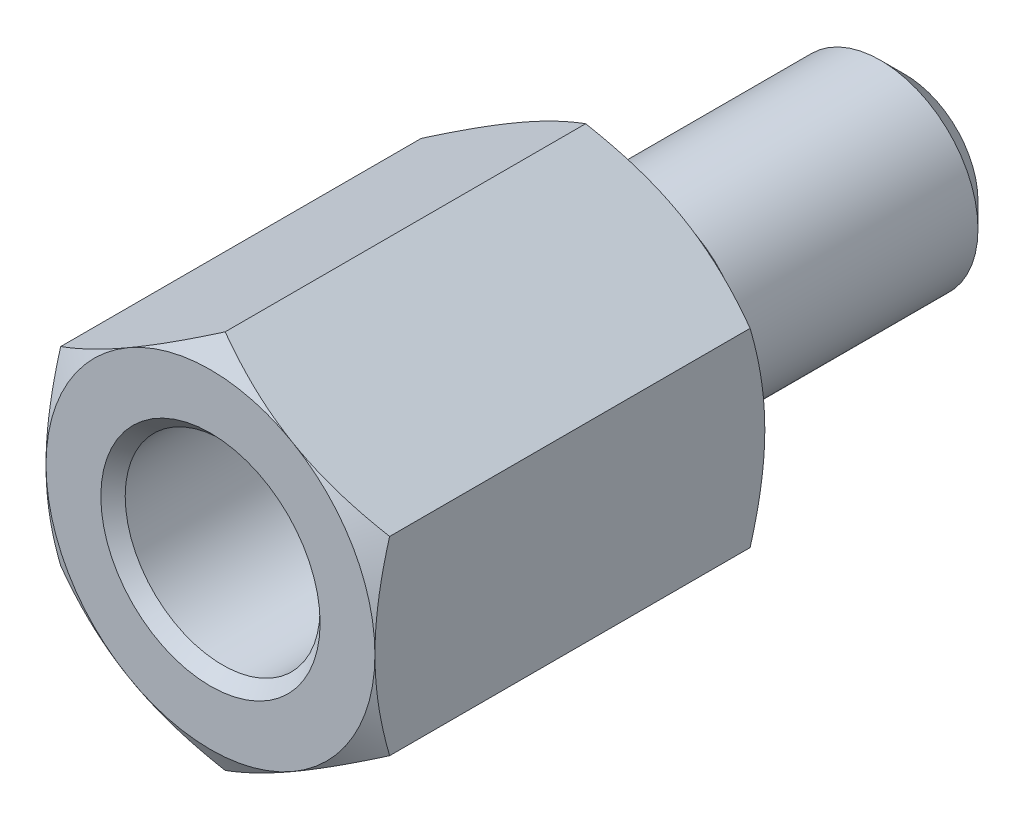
ISO-10303-21;
HEADER;
FILE_DESCRIPTION(('STEP AP214'),'2;1');
FILE_NAME('part.step','',(''),(''),'','','');
FILE_SCHEMA(('AUTOMOTIVE_DESIGN { 1 0 10303 214 1 1 1 1 }'));
ENDSEC;
DATA;
#1=APPLICATION_CONTEXT('core data for automotive mechanical design processes');
#2=APPLICATION_PROTOCOL_DEFINITION('international standard','automotive_design',2000,#1);
#3=PRODUCT_CONTEXT('',#1,'mechanical');
#4=PRODUCT('Part','Part','',(#3));
#5=PRODUCT_RELATED_PRODUCT_CATEGORY('part','',(#4));
#6=PRODUCT_DEFINITION_FORMATION('','',#4);
#7=PRODUCT_DEFINITION_CONTEXT('part definition',#1,'design');
#8=PRODUCT_DEFINITION('design','',#6,#7);
#9=PRODUCT_DEFINITION_SHAPE('','',#8);
#10=(LENGTH_UNIT() NAMED_UNIT(*) SI_UNIT(.MILLI.,.METRE.));
#11=(NAMED_UNIT(*) PLANE_ANGLE_UNIT() SI_UNIT($,.RADIAN.));
#12=(NAMED_UNIT(*) SI_UNIT($,.STERADIAN.) SOLID_ANGLE_UNIT());
#13=UNCERTAINTY_MEASURE_WITH_UNIT(LENGTH_MEASURE(1.E-05),#10,'distance_accuracy_value','');
#14=(GEOMETRIC_REPRESENTATION_CONTEXT(3) GLOBAL_UNCERTAINTY_ASSIGNED_CONTEXT((#13)) GLOBAL_UNIT_ASSIGNED_CONTEXT((#10,
#11,#12)) REPRESENTATION_CONTEXT('',''));
#15=CARTESIAN_POINT('',(0.,0.,0.));
#16=DIRECTION('',(0.,0.,1.));
#17=DIRECTION('',(1.,0.,0.));
#18=AXIS2_PLACEMENT_3D('',#15,#16,#17);
#19=CARTESIAN_POINT('',(0.,15.5884572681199,0.));
#20=DIRECTION('',(-0.5,-0.866025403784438,0.));
#21=DIRECTION('',(0.866025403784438,-0.5,0.));
#22=AXIS2_PLACEMENT_3D('',#19,#20,#21);
#23=PLANE('',#22);
#24=CARTESIAN_POINT('',(-0.000199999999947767,15.5885727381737,1.20583803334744));
#25=CARTESIAN_POINT('',(0.296524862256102,15.417258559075,1.10693600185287));
#26=CARTESIAN_POINT('',(0.59440711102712,15.2452761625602,1.01252193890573));
#27=CARTESIAN_POINT('',(1.19256027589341,14.899932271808,0.833917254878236));
#28=CARTESIAN_POINT('',(1.49283194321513,14.7265703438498,0.749729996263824));
#29=CARTESIAN_POINT('',(2.0963442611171,14.3781323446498,0.592710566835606));
#30=CARTESIAN_POINT('',(2.39959019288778,14.2030532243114,0.519905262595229));
#31=CARTESIAN_POINT('',(3.00818925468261,13.8516783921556,0.387213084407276));
#32=CARTESIAN_POINT('',(3.31354226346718,13.6753827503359,0.327325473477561));
#33=CARTESIAN_POINT('',(3.91853115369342,13.3260922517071,0.223015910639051));
#34=CARTESIAN_POINT('',(4.2181221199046,13.1531233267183,0.17824871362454));
#35=CARTESIAN_POINT('',(4.81867684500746,12.8063928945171,0.103183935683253));
#36=CARTESIAN_POINT('',(5.11964063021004,12.632631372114,0.0728866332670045));
#37=CARTESIAN_POINT('',(5.72207378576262,12.284816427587,0.0275266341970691));
#38=CARTESIAN_POINT('',(6.02354212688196,12.1107635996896,0.0124458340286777));
#39=CARTESIAN_POINT('',(6.62675710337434,11.7624972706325,-0.00215683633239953));
#40=CARTESIAN_POINT('',(6.92850372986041,11.5882837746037,-0.00167918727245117));
#41=CARTESIAN_POINT('',(7.49261810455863,11.2625921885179,0.0137483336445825));
#42=CARTESIAN_POINT('',(7.75502605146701,11.1110908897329,0.0268164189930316));
#43=CARTESIAN_POINT('',(8.27923834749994,10.8084367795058,0.0644725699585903));
#44=CARTESIAN_POINT('',(8.54104265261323,10.6572839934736,0.0890614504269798));
#45=CARTESIAN_POINT('',(9.06390546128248,10.3554090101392,0.14933046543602));
#46=CARTESIAN_POINT('',(9.32496316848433,10.2046872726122,0.185019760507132));
#47=CARTESIAN_POINT('',(9.84585469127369,9.90395041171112,0.266863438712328));
#48=CARTESIAN_POINT('',(10.1056884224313,9.75393533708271,0.313018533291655));
#49=CARTESIAN_POINT('',(10.8944281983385,9.29855621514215,0.468349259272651));
#50=CARTESIAN_POINT('',(11.4210501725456,8.99451087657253,0.593013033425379));
#51=CARTESIAN_POINT('',(12.4664415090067,8.3909539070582,0.875948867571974));
#52=CARTESIAN_POINT('',(12.9852242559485,8.09143454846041,1.03415447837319));
#53=CARTESIAN_POINT('',(13.5002,7.79411316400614,1.20583803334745));
#54=B_SPLINE_CURVE_WITH_KNOTS('',3,(#24,#25,#26,#27,#28,#29,#30,#31,#32,#33,#34,#35,#36,#37,#38,
#39,#40,#41,#42,#43,#44,#45,#46,#47,#48,#49,#50,#51,#52,#53),.UNSPECIFIED.,.F.,.F.,(4,2,2,2,2,2,
2,2,2,2,2,2,2,2,4),(0.,1.06987949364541,2.14010980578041,3.21282939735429,4.28548777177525,
5.33167033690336,6.37787303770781,7.42282956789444,8.46775380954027,9.377387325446,
10.2870851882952,11.1975357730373,12.1080482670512,13.9691139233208,15.8265265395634),.UNSPECIFIED.);
#55=CARTESIAN_POINT('',(0.,15.5884572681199,1.20577136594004));
#56=VERTEX_POINT('',#55);
#57=CARTESIAN_POINT('',(6.75,11.6913429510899,0.));
#58=VERTEX_POINT('',#57);
#59=EDGE_CURVE('E233',#56,#58,#54,.T.);
#60=ORIENTED_EDGE('',*,*,#59,.F.);
#61=DIRECTION('',(0.,0.,1.));
#62=VECTOR('',#61,1.);
#63=CARTESIAN_POINT('',(0.,15.5884572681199,0.));
#64=LINE('',#63,#62);
#65=CARTESIAN_POINT('',(0.,15.5884572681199,30.79422863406));
#66=VERTEX_POINT('',#65);
#67=EDGE_CURVE('E275',#56,#66,#64,.T.);
#68=ORIENTED_EDGE('',*,*,#67,.T.);
#69=CARTESIAN_POINT('',(13.5002,7.79411316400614,30.7941619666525));
#70=CARTESIAN_POINT('',(13.2034751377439,7.96542734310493,30.8930639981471));
#71=CARTESIAN_POINT('',(12.9055928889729,8.13740973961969,30.9874780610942));
#72=CARTESIAN_POINT('',(12.3074397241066,8.48275363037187,31.1660827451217));
#73=CARTESIAN_POINT('',(12.0071680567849,8.65611555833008,31.2502700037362));
#74=CARTESIAN_POINT('',(11.4036557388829,9.00455355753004,31.4072894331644));
#75=CARTESIAN_POINT('',(11.1004098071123,9.1796326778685,31.4800947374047));
#76=CARTESIAN_POINT('',(10.4918107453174,9.5310075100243,31.6127869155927));
#77=CARTESIAN_POINT('',(10.1864577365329,9.70730315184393,31.6726745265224));
#78=CARTESIAN_POINT('',(9.58146884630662,10.0565936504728,31.7769840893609));
#79=CARTESIAN_POINT('',(9.28187788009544,10.2295625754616,31.8217512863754));
#80=CARTESIAN_POINT('',(8.68132315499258,10.5762930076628,31.8968160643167));
#81=CARTESIAN_POINT('',(8.38035936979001,10.7500545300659,31.927113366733));
#82=CARTESIAN_POINT('',(7.77792621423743,11.0978694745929,31.9724733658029));
#83=CARTESIAN_POINT('',(7.47645787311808,11.2719223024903,31.9875541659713));
#84=CARTESIAN_POINT('',(6.87324289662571,11.6201886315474,32.0021568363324));
#85=CARTESIAN_POINT('',(6.57149627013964,11.7944021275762,32.0016791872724));
#86=CARTESIAN_POINT('',(6.00738189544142,12.1200937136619,31.9862516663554));
#87=CARTESIAN_POINT('',(5.74497394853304,12.271595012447,31.973183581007));
#88=CARTESIAN_POINT('',(5.22076165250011,12.5742491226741,31.9355274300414));
#89=CARTESIAN_POINT('',(4.95895734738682,12.7254019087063,31.910938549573));
#90=CARTESIAN_POINT('',(4.43609453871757,13.0272768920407,31.850669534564));
#91=CARTESIAN_POINT('',(4.17503683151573,13.1779986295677,31.8149802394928));
#92=CARTESIAN_POINT('',(3.65414530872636,13.4787354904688,31.7331365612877));
#93=CARTESIAN_POINT('',(3.39431157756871,13.6287505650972,31.6869814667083));
#94=CARTESIAN_POINT('',(2.60557180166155,14.0841296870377,31.5316507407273));
#95=CARTESIAN_POINT('',(2.0789498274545,14.3881750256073,31.4069869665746));
#96=CARTESIAN_POINT('',(1.03355849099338,14.9917319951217,31.124051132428));
#97=CARTESIAN_POINT('',(0.514775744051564,15.2912513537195,30.9658455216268));
#98=CARTESIAN_POINT('',(-0.000199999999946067,15.5885727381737,30.7941619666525));
#99=B_SPLINE_CURVE_WITH_KNOTS('',3,(#69,#70,#71,#72,#73,#74,#75,#76,#77,#78,#79,#80,#81,#82,#83,
#84,#85,#86,#87,#88,#89,#90,#91,#92,#93,#94,#95,#96,#97,#98),.UNSPECIFIED.,.F.,.F.,(4,2,2,2,2,2,
2,2,2,2,2,2,2,2,4),(0.,1.0698794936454,2.14010980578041,3.21282939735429,4.28548777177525,
5.33167033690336,6.37787303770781,7.42282956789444,8.46775380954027,9.37738732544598,
10.2870851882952,11.1975357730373,12.1080482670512,13.9691139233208,15.8265265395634),.UNSPECIFIED.);
#100=CARTESIAN_POINT('',(6.75,11.6913429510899,32.));
#101=VERTEX_POINT('',#100);
#102=EDGE_CURVE('E219',#101,#66,#99,.T.);
#103=ORIENTED_EDGE('',*,*,#102,.F.);
#104=CARTESIAN_POINT('',(13.5,7.79422863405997,30.79422863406));
#105=VERTEX_POINT('',#104);
#106=EDGE_CURVE('E225',#105,#101,#99,.T.);
#107=ORIENTED_EDGE('',*,*,#106,.F.);
#108=DIRECTION('',(0.,0.,1.));
#109=VECTOR('',#108,1.);
#110=CARTESIAN_POINT('',(13.5,7.79422863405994,0.));
#111=LINE('',#110,#109);
#112=CARTESIAN_POINT('',(13.5,7.79422863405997,1.20577136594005));
#113=VERTEX_POINT('',#112);
#114=EDGE_CURVE('E282',#113,#105,#111,.T.);
#115=ORIENTED_EDGE('',*,*,#114,.F.);
#116=EDGE_CURVE('E109',#58,#113,#54,.T.);
#117=ORIENTED_EDGE('',*,*,#116,.F.);
#118=EDGE_LOOP('',(#60,#68,#103,#107,#115,#117));
#119=FACE_BOUND('',#118,.T.);
#120=ADVANCED_FACE('F14',(#119),#23,.F.);
#121=CARTESIAN_POINT('',(13.5,7.79422863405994,0.));
#122=DIRECTION('',(-1.,0.,0.));
#123=DIRECTION('',(0.,-1.,0.));
#124=AXIS2_PLACEMENT_3D('',#121,#122,#123);
#125=PLANE('',#124);
#126=CARTESIAN_POINT('',(13.5,-20.9796600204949,6.60942986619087));
#127=CARTESIAN_POINT('',(13.5,-20.6846775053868,6.46621369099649));
#128=CARTESIAN_POINT('',(13.5,-20.3893500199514,6.32370838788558));
#129=CARTESIAN_POINT('',(13.5,-19.7979331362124,6.04028043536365));
#130=CARTESIAN_POINT('',(13.5,-19.5018437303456,5.89935780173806));
#131=CARTESIAN_POINT('',(13.5,-18.6122464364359,5.47916841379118));
#132=CARTESIAN_POINT('',(13.5,-18.0174960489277,5.20252232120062));
#133=CARTESIAN_POINT('',(13.5,-16.8208138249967,4.65640292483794));
#134=CARTESIAN_POINT('',(13.5,-16.2188605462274,4.38697649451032));
#135=CARTESIAN_POINT('',(13.5,-15.0101822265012,3.85908680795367));
#136=CARTESIAN_POINT('',(13.5,-14.4034574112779,3.60062303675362));
#137=CARTESIAN_POINT('',(13.5,-13.1644926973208,3.08939714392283));
#138=CARTESIAN_POINT('',(13.5,-12.5320633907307,2.83709167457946));
#139=CARTESIAN_POINT('',(13.5,-11.2598172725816,2.35147029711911));
#140=CARTESIAN_POINT('',(13.5,-10.619999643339,2.1181565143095));
#141=CARTESIAN_POINT('',(13.5,-9.33316345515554,1.67661536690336));
#142=CARTESIAN_POINT('',(13.5,-8.68616233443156,1.46833758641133));
#143=CARTESIAN_POINT('',(13.5,-7.38281775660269,1.08351128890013));
#144=CARTESIAN_POINT('',(13.5,-6.72647729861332,0.906952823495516));
#145=CARTESIAN_POINT('',(13.5,-5.73666859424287,0.672757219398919));
#146=CARTESIAN_POINT('',(13.5,-5.40676632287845,0.599957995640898));
#147=CARTESIAN_POINT('',(13.5,-4.74469949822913,0.4654357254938));
#148=CARTESIAN_POINT('',(13.5,-4.4125349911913,0.403712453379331));
#149=CARTESIAN_POINT('',(13.5,-3.7461693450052,0.29242889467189));
#150=CARTESIAN_POINT('',(13.5,-3.41196823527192,0.242868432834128));
#151=CARTESIAN_POINT('',(13.5,-2.74188022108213,0.15689757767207));
#152=CARTESIAN_POINT('',(13.5,-2.40599338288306,0.120486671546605));
#153=CARTESIAN_POINT('',(13.5,-1.7374073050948,0.0619971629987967));
#154=CARTESIAN_POINT('',(13.5,-1.40472406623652,0.0397367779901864));
#155=CARTESIAN_POINT('',(13.5,-0.738714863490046,0.00930714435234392));
#156=CARTESIAN_POINT('',(13.5,-0.405388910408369,0.00113766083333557));
#157=CARTESIAN_POINT('',(13.5,0.261310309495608,-0.000915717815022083));
#158=CARTESIAN_POINT('',(13.5,0.594683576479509,0.00520043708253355));
#159=CARTESIAN_POINT('',(13.5,1.26087446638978,0.0315686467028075));
#160=CARTESIAN_POINT('',(13.5,1.59369206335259,0.0518213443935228));
#161=CARTESIAN_POINT('',(13.5,2.39225374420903,0.116944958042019));
#162=CARTESIAN_POINT('',(13.5,2.85746635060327,0.168450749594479));
#163=CARTESIAN_POINT('',(13.5,3.7844701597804,0.296288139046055));
#164=CARTESIAN_POINT('',(13.5,4.24626089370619,0.372623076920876));
#165=CARTESIAN_POINT('',(13.5,5.16597046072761,0.547403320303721));
#166=CARTESIAN_POINT('',(13.5,5.62388600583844,0.6458657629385));
#167=CARTESIAN_POINT('',(13.5,6.53513879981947,0.861893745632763));
#168=CARTESIAN_POINT('',(13.5,6.98847611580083,0.979459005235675));
#169=CARTESIAN_POINT('',(13.5,7.90054660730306,1.23360912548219));
#170=CARTESIAN_POINT('',(13.5,8.35917807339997,1.37055646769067));
#171=CARTESIAN_POINT('',(13.5,9.27192363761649,1.65868167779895));
#172=CARTESIAN_POINT('',(13.5,9.72603770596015,1.80985963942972));
#173=CARTESIAN_POINT('',(13.5,10.6299712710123,2.12403866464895));
#174=CARTESIAN_POINT('',(13.5,11.079792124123,2.28703584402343));
#175=CARTESIAN_POINT('',(13.5,11.9757013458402,2.62292779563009));
#176=CARTESIAN_POINT('',(13.5,12.4217897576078,2.79582245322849));
#177=CARTESIAN_POINT('',(13.5,13.4719443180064,3.21411289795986));
#178=CARTESIAN_POINT('',(13.5,14.0745972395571,3.46305130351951));
#179=CARTESIAN_POINT('',(13.5,15.2747825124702,3.97301525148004));
#180=CARTESIAN_POINT('',(13.5,15.8723145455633,4.23404153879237));
#181=CARTESIAN_POINT('',(13.5,17.0632077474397,4.76576823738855));
#182=CARTESIAN_POINT('',(13.5,17.6565679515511,5.03647080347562));
#183=CARTESIAN_POINT('',(13.5,18.8396773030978,5.58560363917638));
#184=CARTESIAN_POINT('',(13.5,19.4294265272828,5.86403374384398));
#185=CARTESIAN_POINT('',(13.5,20.6065558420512,6.42748916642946));
#186=CARTESIAN_POINT('',(13.5,21.1939326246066,6.71252138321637));
#187=CARTESIAN_POINT('',(13.5,22.3661462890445,7.28776061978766));
#188=CARTESIAN_POINT('',(13.5,22.9509831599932,7.57796766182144));
#189=CARTESIAN_POINT('',(13.5,24.118430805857,8.16263363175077));
#190=CARTESIAN_POINT('',(13.5,24.7010418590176,8.45709200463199));
#191=CARTESIAN_POINT('',(13.5,25.8644342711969,9.04960332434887));
#192=CARTESIAN_POINT('',(13.5,26.4452156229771,9.34765628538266));
#193=CARTESIAN_POINT('',(13.5,28.088140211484,10.1962060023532));
#194=CARTESIAN_POINT('',(13.5,29.1484436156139,10.7502649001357));
#195=CARTESIAN_POINT('',(13.5,31.265090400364,11.8659681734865));
#196=CARTESIAN_POINT('',(13.5,32.3214336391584,12.4276128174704));
#197=CARTESIAN_POINT('',(13.5,34.4283736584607,13.5553013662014));
#198=CARTESIAN_POINT('',(13.5,35.4789782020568,14.1213307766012));
#199=CARTESIAN_POINT('',(13.5,37.053015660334,14.9737537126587));
#200=CARTESIAN_POINT('',(13.5,37.577369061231,15.2584500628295));
#201=CARTESIAN_POINT('',(13.5,38.6255231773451,15.8288564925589));
#202=CARTESIAN_POINT('',(13.5,39.1493238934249,16.1145665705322));
#203=CARTESIAN_POINT('',(13.5,39.672879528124,16.4007251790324));
#204=B_SPLINE_CURVE_WITH_KNOTS('',3,(#126,#127,#128,#129,#130,#131,#132,#133,#134,#135,#136,
#137,#138,#139,#140,#141,#142,#143,#144,#145,#146,#147,#148,#149,#150,#151,#152,#153,#154,#155,
#156,#157,#158,#159,#160,#161,#162,#163,#164,#165,#166,#167,#168,#169,#170,#171,#172,#173,#174,
#175,#176,#177,#178,#179,#180,#181,#182,#183,#184,#185,#186,#187,#188,#189,#190,#191,#192,#193,
#194,#195,#196,#197,#198,#199,#200,#201,#202,#203),.UNSPECIFIED.,.F.,.F.,(4,2,2,2,2,2,2,2,2,2,2,
2,2,2,2,2,2,2,2,2,2,2,2,2,2,2,2,2,2,2,2,2,2,2,2,2,2,2,4),(0.,0.983730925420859,1.96747165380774,
3.935241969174,5.91365245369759,7.89196989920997,9.93443715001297,11.9771326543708,
14.0156432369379,16.053513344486,17.0668746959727,18.0802153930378,19.0935414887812,
20.1068280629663,21.1068195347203,22.1067943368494,23.1067726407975,24.1067964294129,
25.5101862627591,26.9137649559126,28.318434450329,29.7230833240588,31.1587310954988,
32.5943883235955,34.0295758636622,35.4647467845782,37.4206988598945,39.3767716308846,
41.3332827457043,43.2897521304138,45.2483674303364,47.2069911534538,49.1653614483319,
51.123739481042,54.7127069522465,58.3018017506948,61.8819308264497,63.6718982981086,
65.4618629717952),.UNSPECIFIED.);
#205=CARTESIAN_POINT('',(13.5,0.,0.));
#206=VERTEX_POINT('',#205);
#207=EDGE_CURVE('E102',#113,#206,#204,.F.);
#208=ORIENTED_EDGE('',*,*,#207,.F.);
#209=ORIENTED_EDGE('',*,*,#114,.T.);
#210=CARTESIAN_POINT('',(13.5,-20.9796600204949,25.3905701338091));
#211=CARTESIAN_POINT('',(13.5,-20.6846775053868,25.5337863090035));
#212=CARTESIAN_POINT('',(13.5,-20.3893500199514,25.6762916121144));
#213=CARTESIAN_POINT('',(13.5,-19.7979331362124,25.9597195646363));
#214=CARTESIAN_POINT('',(13.5,-19.5018437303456,26.1006421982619));
#215=CARTESIAN_POINT('',(13.5,-18.6122464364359,26.5208315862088));
#216=CARTESIAN_POINT('',(13.5,-18.0174960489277,26.7974776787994));
#217=CARTESIAN_POINT('',(13.5,-16.8208138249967,27.343597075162));
#218=CARTESIAN_POINT('',(13.5,-16.2188605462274,27.6130235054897));
#219=CARTESIAN_POINT('',(13.5,-15.0101822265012,28.1409131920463));
#220=CARTESIAN_POINT('',(13.5,-14.4034574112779,28.3993769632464));
#221=CARTESIAN_POINT('',(13.5,-13.1644926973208,28.9106028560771));
#222=CARTESIAN_POINT('',(13.5,-12.5320633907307,29.1629083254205));
#223=CARTESIAN_POINT('',(13.5,-11.2598172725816,29.6485297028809));
#224=CARTESIAN_POINT('',(13.5,-10.619999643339,29.8818434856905));
#225=CARTESIAN_POINT('',(13.5,-9.33316345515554,30.3233846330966));
#226=CARTESIAN_POINT('',(13.5,-8.68616233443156,30.5316624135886));
#227=CARTESIAN_POINT('',(13.5,-7.38281775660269,30.9164887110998));
#228=CARTESIAN_POINT('',(13.5,-6.72647729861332,31.0930471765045));
#229=CARTESIAN_POINT('',(13.5,-5.73666859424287,31.3272427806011));
#230=CARTESIAN_POINT('',(13.5,-5.40676632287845,31.4000420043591));
#231=CARTESIAN_POINT('',(13.5,-4.74469949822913,31.5345642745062));
#232=CARTESIAN_POINT('',(13.5,-4.4125349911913,31.5962875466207));
#233=CARTESIAN_POINT('',(13.5,-3.7461693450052,31.7075711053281));
#234=CARTESIAN_POINT('',(13.5,-3.41196823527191,31.7571315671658));
#235=CARTESIAN_POINT('',(13.5,-2.74188022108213,31.8431024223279));
#236=CARTESIAN_POINT('',(13.5,-2.40599338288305,31.8795133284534));
#237=CARTESIAN_POINT('',(13.5,-1.7374073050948,31.9380028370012));
#238=CARTESIAN_POINT('',(13.5,-1.40472406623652,31.9602632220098));
#239=CARTESIAN_POINT('',(13.5,-0.738714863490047,31.9906928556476));
#240=CARTESIAN_POINT('',(13.5,-0.405388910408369,31.9988623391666));
#241=CARTESIAN_POINT('',(13.5,0.261310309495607,32.000915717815));
#242=CARTESIAN_POINT('',(13.5,0.594683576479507,31.9947995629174));
#243=CARTESIAN_POINT('',(13.5,1.26087446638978,31.9684313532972));
#244=CARTESIAN_POINT('',(13.5,1.59369206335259,31.9481786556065));
#245=CARTESIAN_POINT('',(13.5,2.39225374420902,31.883055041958));
#246=CARTESIAN_POINT('',(13.5,2.85746635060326,31.8315492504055));
#247=CARTESIAN_POINT('',(13.5,3.78447015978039,31.7037118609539));
#248=CARTESIAN_POINT('',(13.5,4.24626089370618,31.6273769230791));
#249=CARTESIAN_POINT('',(13.5,5.1659704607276,31.4525966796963));
#250=CARTESIAN_POINT('',(13.5,5.62388600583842,31.3541342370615));
#251=CARTESIAN_POINT('',(13.5,6.53513879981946,31.1381062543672));
#252=CARTESIAN_POINT('',(13.5,6.98847611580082,31.0205409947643));
#253=CARTESIAN_POINT('',(13.5,7.90054660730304,30.7663908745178));
#254=CARTESIAN_POINT('',(13.5,8.35917807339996,30.6294435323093));
#255=CARTESIAN_POINT('',(13.5,9.27192363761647,30.341318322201));
#256=CARTESIAN_POINT('',(13.5,9.72603770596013,30.1901403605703));
#257=CARTESIAN_POINT('',(13.5,10.6299712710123,29.875961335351));
#258=CARTESIAN_POINT('',(13.5,11.0797921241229,29.7129641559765));
#259=CARTESIAN_POINT('',(13.5,11.9757013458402,29.3770722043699));
#260=CARTESIAN_POINT('',(13.5,12.4217897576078,29.2041775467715));
#261=CARTESIAN_POINT('',(13.5,13.4719443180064,28.7858871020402));
#262=CARTESIAN_POINT('',(13.5,14.0745972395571,28.5369486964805));
#263=CARTESIAN_POINT('',(13.5,15.2747825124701,28.0269847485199));
#264=CARTESIAN_POINT('',(13.5,15.8723145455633,27.7659584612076));
#265=CARTESIAN_POINT('',(13.5,17.0632077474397,27.2342317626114));
#266=CARTESIAN_POINT('',(13.5,17.6565679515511,26.9635291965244));
#267=CARTESIAN_POINT('',(13.5,18.8396773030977,26.4143963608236));
#268=CARTESIAN_POINT('',(13.5,19.4294265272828,26.135966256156));
#269=CARTESIAN_POINT('',(13.5,20.6065558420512,25.5725108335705));
#270=CARTESIAN_POINT('',(13.5,21.1939326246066,25.2874786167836));
#271=CARTESIAN_POINT('',(13.5,22.3661462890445,24.7122393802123));
#272=CARTESIAN_POINT('',(13.5,22.9509831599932,24.4220323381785));
#273=CARTESIAN_POINT('',(13.5,24.118430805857,23.8373663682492));
#274=CARTESIAN_POINT('',(13.5,24.7010418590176,23.542907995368));
#275=CARTESIAN_POINT('',(13.5,25.8644342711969,22.9503966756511));
#276=CARTESIAN_POINT('',(13.5,26.4452156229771,22.6523437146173));
#277=CARTESIAN_POINT('',(13.5,28.088140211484,21.8037939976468));
#278=CARTESIAN_POINT('',(13.5,29.1484436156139,21.2497350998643));
#279=CARTESIAN_POINT('',(13.5,31.265090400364,20.1340318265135));
#280=CARTESIAN_POINT('',(13.5,32.3214336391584,19.5723871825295));
#281=CARTESIAN_POINT('',(13.5,34.4283736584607,18.4446986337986));
#282=CARTESIAN_POINT('',(13.5,35.4789782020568,17.8786692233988));
#283=CARTESIAN_POINT('',(13.5,37.053015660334,17.0262462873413));
#284=CARTESIAN_POINT('',(13.5,37.577369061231,16.7415499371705));
#285=CARTESIAN_POINT('',(13.5,38.6255231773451,16.1711435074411));
#286=CARTESIAN_POINT('',(13.5,39.1493238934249,15.8854334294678));
#287=CARTESIAN_POINT('',(13.5,39.672879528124,15.5992748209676));
#288=B_SPLINE_CURVE_WITH_KNOTS('',3,(#210,#211,#212,#213,#214,#215,#216,#217,#218,#219,#220,
#221,#222,#223,#224,#225,#226,#227,#228,#229,#230,#231,#232,#233,#234,#235,#236,#237,#238,#239,
#240,#241,#242,#243,#244,#245,#246,#247,#248,#249,#250,#251,#252,#253,#254,#255,#256,#257,#258,
#259,#260,#261,#262,#263,#264,#265,#266,#267,#268,#269,#270,#271,#272,#273,#274,#275,#276,#277,
#278,#279,#280,#281,#282,#283,#284,#285,#286,#287),.UNSPECIFIED.,.F.,.F.,(4,2,2,2,2,2,2,2,2,2,2,
2,2,2,2,2,2,2,2,2,2,2,2,2,2,2,2,2,2,2,2,2,2,2,2,2,2,2,4),(0.,0.983730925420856,1.96747165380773,
3.93524196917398,5.91365245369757,7.89196989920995,9.93443715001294,11.9771326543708,
14.0156432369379,16.053513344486,17.0668746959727,18.0802153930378,19.0935414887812,
20.1068280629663,21.1068195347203,22.1067943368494,23.1067726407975,24.1067964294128,
25.5101862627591,26.9137649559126,28.318434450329,29.7230833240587,31.1587310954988,
32.5943883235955,34.0295758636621,35.4647467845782,37.4206988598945,39.3767716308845,
41.3332827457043,43.2897521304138,45.2483674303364,47.2069911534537,49.1653614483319,
51.123739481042,54.7127069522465,58.3018017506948,61.8819308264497,63.6718982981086,
65.4618629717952),.UNSPECIFIED.);
#289=CARTESIAN_POINT('',(13.5,0.,32.));
#290=VERTEX_POINT('',#289);
#291=EDGE_CURVE('E167',#290,#105,#288,.T.);
#292=ORIENTED_EDGE('',*,*,#291,.F.);
#293=CARTESIAN_POINT('',(13.5,-7.79422863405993,30.79422863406));
#294=VERTEX_POINT('',#293);
#295=EDGE_CURVE('E175',#294,#290,#288,.T.);
#296=ORIENTED_EDGE('',*,*,#295,.F.);
#297=DIRECTION('',(0.,0.,1.));
#298=VECTOR('',#297,1.);
#299=CARTESIAN_POINT('',(13.5,-7.79422863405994,0.));
#300=LINE('',#299,#298);
#301=CARTESIAN_POINT('',(13.5,-7.79422863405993,1.20577136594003));
#302=VERTEX_POINT('',#301);
#303=EDGE_CURVE('E137',#302,#294,#300,.T.);
#304=ORIENTED_EDGE('',*,*,#303,.F.);
#305=EDGE_CURVE('E114',#206,#302,#204,.F.);
#306=ORIENTED_EDGE('',*,*,#305,.F.);
#307=EDGE_LOOP('',(#208,#209,#292,#296,#304,#306));
#308=FACE_BOUND('',#307,.T.);
#309=ADVANCED_FACE('F135',(#308),#125,.F.);
#310=CARTESIAN_POINT('',(0.,-15.5884572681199,0.));
#311=DIRECTION('',(0.5,-0.866025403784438,0.));
#312=DIRECTION('',(0.866025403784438,0.5,0.));
#313=AXIS2_PLACEMENT_3D('',#310,#311,#312);
#314=PLANE('',#313);
#315=DIRECTION('',(0.,0.,1.));
#316=VECTOR('',#315,1.);
#317=CARTESIAN_POINT('',(0.,-15.5884572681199,0.));
#318=LINE('',#317,#316);
#319=CARTESIAN_POINT('',(0.,-15.5884572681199,1.20577136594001));
#320=VERTEX_POINT('',#319);
#321=CARTESIAN_POINT('',(0.,-15.5884572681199,30.79422863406));
#322=VERTEX_POINT('',#321);
#323=EDGE_CURVE('E277',#320,#322,#318,.T.);
#324=ORIENTED_EDGE('',*,*,#323,.F.);
#325=CARTESIAN_POINT('',(-0.000199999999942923,-15.5885727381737,1.20583803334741));
#326=CARTESIAN_POINT('',(0.296524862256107,-15.4172585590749,1.10693600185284));
#327=CARTESIAN_POINT('',(0.594407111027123,-15.2452761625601,1.0125219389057));
#328=CARTESIAN_POINT('',(1.19256027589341,-14.899932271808,0.833917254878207));
#329=CARTESIAN_POINT('',(1.49283194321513,-14.7265703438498,0.749729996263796));
#330=CARTESIAN_POINT('',(2.0963442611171,-14.3781323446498,0.592710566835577));
#331=CARTESIAN_POINT('',(2.39959019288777,-14.2030532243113,0.519905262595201));
#332=CARTESIAN_POINT('',(3.0081892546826,-13.8516783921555,0.387213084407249));
#333=CARTESIAN_POINT('',(3.31354226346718,-13.6753827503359,0.327325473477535));
#334=CARTESIAN_POINT('',(3.91853115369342,-13.3260922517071,0.223015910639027));
#335=CARTESIAN_POINT('',(4.21812211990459,-13.1531233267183,0.178248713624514));
#336=CARTESIAN_POINT('',(4.81867684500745,-12.806392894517,0.103183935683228));
#337=CARTESIAN_POINT('',(5.11964063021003,-12.632631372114,0.0728866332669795));
#338=CARTESIAN_POINT('',(5.72207378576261,-12.2848164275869,0.0275266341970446));
#339=CARTESIAN_POINT('',(6.02354212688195,-12.1107635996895,0.0124458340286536));
#340=CARTESIAN_POINT('',(6.62675710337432,-11.7624972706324,-0.00215683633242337));
#341=CARTESIAN_POINT('',(6.92850372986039,-11.5882837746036,-0.00167918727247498));
#342=CARTESIAN_POINT('',(7.49261810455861,-11.2625921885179,0.0137483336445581));
#343=CARTESIAN_POINT('',(7.75502605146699,-11.1110908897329,0.0268164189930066));
#344=CARTESIAN_POINT('',(8.27923834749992,-10.8084367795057,0.0644725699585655));
#345=CARTESIAN_POINT('',(8.54104265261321,-10.6572839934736,0.0890614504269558));
#346=CARTESIAN_POINT('',(9.06390546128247,-10.3554090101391,0.149330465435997));
#347=CARTESIAN_POINT('',(9.32496316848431,-10.2046872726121,0.18501976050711));
#348=CARTESIAN_POINT('',(9.84585469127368,-9.90395041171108,0.266863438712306));
#349=CARTESIAN_POINT('',(10.1056884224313,-9.75393533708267,0.313018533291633));
#350=CARTESIAN_POINT('',(10.8944281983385,-9.2985562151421,0.468349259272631));
#351=CARTESIAN_POINT('',(11.4210501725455,-8.99451087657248,0.593013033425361));
#352=CARTESIAN_POINT('',(12.4664415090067,-8.39095390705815,0.875948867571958));
#353=CARTESIAN_POINT('',(12.9852242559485,-8.09143454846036,1.03415447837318));
#354=CARTESIAN_POINT('',(13.5002,-7.79411316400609,1.20583803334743));
#355=B_SPLINE_CURVE_WITH_KNOTS('',3,(#325,#326,#327,#328,#329,#330,#331,#332,#333,#334,#335,
#336,#337,#338,#339,#340,#341,#342,#343,#344,#345,#346,#347,#348,#349,#350,#351,#352,#353,#354),
.UNSPECIFIED.,.F.,.F.,(4,2,2,2,2,2,2,2,2,2,2,2,2,2,4),(0.,1.0698794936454,2.14010980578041,
3.21282939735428,4.28548777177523,5.33167033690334,6.37787303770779,7.42282956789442,
8.46775380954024,9.37738732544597,10.2870851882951,11.1975357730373,12.1080482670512,
13.9691139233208,15.8265265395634),.UNSPECIFIED.);
#356=CARTESIAN_POINT('',(6.75,-11.6913429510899,0.));
#357=VERTEX_POINT('',#356);
#358=EDGE_CURVE('E139',#320,#357,#355,.T.);
#359=ORIENTED_EDGE('',*,*,#358,.T.);
#360=EDGE_CURVE('E121',#357,#302,#355,.T.);
#361=ORIENTED_EDGE('',*,*,#360,.T.);
#362=ORIENTED_EDGE('',*,*,#303,.T.);
#363=CARTESIAN_POINT('',(13.5002,-7.79411316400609,30.7941619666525));
#364=CARTESIAN_POINT('',(13.2034751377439,-7.96542734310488,30.8930639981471));
#365=CARTESIAN_POINT('',(12.9055928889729,-8.13740973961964,30.9874780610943));
#366=CARTESIAN_POINT('',(12.3074397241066,-8.48275363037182,31.1660827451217));
#367=CARTESIAN_POINT('',(12.0071680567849,-8.65611555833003,31.2502700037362));
#368=CARTESIAN_POINT('',(11.403655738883,-9.00455355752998,31.4072894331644));
#369=CARTESIAN_POINT('',(11.1004098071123,-9.17963267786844,31.4800947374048));
#370=CARTESIAN_POINT('',(10.4918107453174,-9.53100751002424,31.6127869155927));
#371=CARTESIAN_POINT('',(10.1864577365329,-9.70730315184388,31.6726745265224));
#372=CARTESIAN_POINT('',(9.58146884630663,-10.0565936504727,31.7769840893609));
#373=CARTESIAN_POINT('',(9.28187788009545,-10.2295625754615,31.8217512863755));
#374=CARTESIAN_POINT('',(8.68132315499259,-10.5762930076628,31.8968160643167));
#375=CARTESIAN_POINT('',(8.38035936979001,-10.7500545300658,31.927113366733));
#376=CARTESIAN_POINT('',(7.77792621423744,-11.0978694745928,31.9724733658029));
#377=CARTESIAN_POINT('',(7.4764578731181,-11.2719223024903,31.9875541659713));
#378=CARTESIAN_POINT('',(6.87324289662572,-11.6201886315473,32.0021568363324));
#379=CARTESIAN_POINT('',(6.57149627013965,-11.7944021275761,32.0016791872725));
#380=CARTESIAN_POINT('',(6.00738189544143,-12.1200937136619,31.9862516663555));
#381=CARTESIAN_POINT('',(5.74497394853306,-12.2715950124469,31.973183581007));
#382=CARTESIAN_POINT('',(5.22076165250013,-12.5742491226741,31.9355274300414));
#383=CARTESIAN_POINT('',(4.95895734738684,-12.7254019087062,31.910938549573));
#384=CARTESIAN_POINT('',(4.43609453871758,-13.0272768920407,31.850669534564));
#385=CARTESIAN_POINT('',(4.17503683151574,-13.1779986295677,31.8149802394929));
#386=CARTESIAN_POINT('',(3.65414530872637,-13.4787354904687,31.7331365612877));
#387=CARTESIAN_POINT('',(3.39431157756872,-13.6287505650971,31.6869814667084));
#388=CARTESIAN_POINT('',(2.60557180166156,-14.0841296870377,31.5316507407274));
#389=CARTESIAN_POINT('',(2.07894982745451,-14.3881750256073,31.4069869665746));
#390=CARTESIAN_POINT('',(1.03355849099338,-14.9917319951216,31.124051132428));
#391=CARTESIAN_POINT('',(0.514775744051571,-15.2912513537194,30.9658455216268));
#392=CARTESIAN_POINT('',(-0.000199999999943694,-15.5885727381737,30.7941619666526));
#393=B_SPLINE_CURVE_WITH_KNOTS('',3,(#363,#364,#365,#366,#367,#368,#369,#370,#371,#372,#373,
#374,#375,#376,#377,#378,#379,#380,#381,#382,#383,#384,#385,#386,#387,#388,#389,#390,#391,#392),
.UNSPECIFIED.,.F.,.F.,(4,2,2,2,2,2,2,2,2,2,2,2,2,2,4),(0.,1.0698794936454,2.14010980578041,
3.21282939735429,4.28548777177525,5.33167033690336,6.37787303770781,7.42282956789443,
8.46775380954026,9.37738732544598,10.2870851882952,11.1975357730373,12.1080482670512,
13.9691139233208,15.8265265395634),.UNSPECIFIED.);
#394=CARTESIAN_POINT('',(6.75,-11.6913429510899,32.));
#395=VERTEX_POINT('',#394);
#396=EDGE_CURVE('E176',#294,#395,#393,.T.);
#397=ORIENTED_EDGE('',*,*,#396,.T.);
#398=EDGE_CURVE('E177',#395,#322,#393,.T.);
#399=ORIENTED_EDGE('',*,*,#398,.T.);
#400=EDGE_LOOP('',(#324,#359,#361,#362,#397,#399));
#401=FACE_BOUND('',#400,.T.);
#402=ADVANCED_FACE('F160',(#401),#314,.T.);
#403=CARTESIAN_POINT('',(0.,-15.5884572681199,0.));
#404=DIRECTION('',(0.5,0.866025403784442,0.));
#405=DIRECTION('',(-0.866025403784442,0.5,0.));
#406=AXIS2_PLACEMENT_3D('',#403,#404,#405);
#407=PLANE('',#406);
#408=CARTESIAN_POINT('',(0.000200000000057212,-15.5885727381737,1.20583803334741));
#409=CARTESIAN_POINT('',(-0.296524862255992,-15.4172585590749,1.10693600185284));
#410=CARTESIAN_POINT('',(-0.594407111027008,-15.2452761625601,1.0125219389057));
#411=CARTESIAN_POINT('',(-1.19256027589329,-14.899932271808,0.833917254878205));
#412=CARTESIAN_POINT('',(-1.49283194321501,-14.7265703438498,0.749729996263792));
#413=CARTESIAN_POINT('',(-2.09634426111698,-14.3781323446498,0.592710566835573));
#414=CARTESIAN_POINT('',(-2.39959019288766,-14.2030532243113,0.519905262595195));
#415=CARTESIAN_POINT('',(-3.00818925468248,-13.8516783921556,0.38721308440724));
#416=CARTESIAN_POINT('',(-3.31354226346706,-13.6753827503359,0.327325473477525));
#417=CARTESIAN_POINT('',(-3.9185311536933,-13.3260922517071,0.223015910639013));
#418=CARTESIAN_POINT('',(-4.21812211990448,-13.1531233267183,0.1782487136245));
#419=CARTESIAN_POINT('',(-4.81867684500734,-12.806392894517,0.103183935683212));
#420=CARTESIAN_POINT('',(-5.11964063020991,-12.632631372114,0.0728866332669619));
#421=CARTESIAN_POINT('',(-5.72207378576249,-12.284816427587,0.0275266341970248));
#422=CARTESIAN_POINT('',(-6.02354212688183,-12.1107635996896,0.0124458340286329));
#423=CARTESIAN_POINT('',(-6.6267571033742,-11.7624972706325,-0.00215683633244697));
#424=CARTESIAN_POINT('',(-6.92850372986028,-11.5882837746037,-0.00167918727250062));
#425=CARTESIAN_POINT('',(-7.4926181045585,-11.2625921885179,0.0137483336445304));
#426=CARTESIAN_POINT('',(-7.75502605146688,-11.1110908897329,0.026816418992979));
#427=CARTESIAN_POINT('',(-8.27923834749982,-10.8084367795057,0.0644725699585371));
#428=CARTESIAN_POINT('',(-8.54104265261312,-10.6572839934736,0.0890614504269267));
#429=CARTESIAN_POINT('',(-9.06390546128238,-10.3554090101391,0.149330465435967));
#430=CARTESIAN_POINT('',(-9.32496316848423,-10.2046872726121,0.18501976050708));
#431=CARTESIAN_POINT('',(-9.84585469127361,-9.90395041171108,0.266863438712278));
#432=CARTESIAN_POINT('',(-10.1056884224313,-9.75393533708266,0.313018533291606));
#433=CARTESIAN_POINT('',(-10.8944281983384,-9.29855621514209,0.468349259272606));
#434=CARTESIAN_POINT('',(-11.4210501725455,-8.99451087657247,0.593013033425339));
#435=CARTESIAN_POINT('',(-12.4664415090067,-8.39095390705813,0.875948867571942));
#436=CARTESIAN_POINT('',(-12.9852242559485,-8.09143454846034,1.03415447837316));
#437=CARTESIAN_POINT('',(-13.5002,-7.79411316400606,1.20583803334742));
#438=B_SPLINE_CURVE_WITH_KNOTS('',3,(#408,#409,#410,#411,#412,#413,#414,#415,#416,#417,#418,
#419,#420,#421,#422,#423,#424,#425,#426,#427,#428,#429,#430,#431,#432,#433,#434,#435,#436,#437),
.UNSPECIFIED.,.F.,.F.,(4,2,2,2,2,2,2,2,2,2,2,2,2,2,4),(0.,1.0698794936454,2.1401098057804,
3.21282939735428,4.28548777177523,5.33167033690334,6.37787303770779,7.42282956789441,
8.46775380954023,9.37738732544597,10.2870851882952,11.1975357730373,12.1080482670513,
13.9691139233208,15.8265265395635),.UNSPECIFIED.);
#439=CARTESIAN_POINT('',(-6.75,-11.6913429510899,0.));
#440=VERTEX_POINT('',#439);
#441=EDGE_CURVE('E250',#320,#440,#438,.T.);
#442=ORIENTED_EDGE('',*,*,#441,.F.);
#443=ORIENTED_EDGE('',*,*,#323,.T.);
#444=CARTESIAN_POINT('',(-13.5002,-7.79411316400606,30.7941619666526));
#445=CARTESIAN_POINT('',(-13.2034751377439,-7.96542734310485,30.8930639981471));
#446=CARTESIAN_POINT('',(-12.9055928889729,-8.13740973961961,30.9874780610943));
#447=CARTESIAN_POINT('',(-12.3074397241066,-8.48275363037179,31.1660827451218));
#448=CARTESIAN_POINT('',(-12.0071680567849,-8.65611555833,31.2502700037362));
#449=CARTESIAN_POINT('',(-11.403655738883,-9.00455355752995,31.4072894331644));
#450=CARTESIAN_POINT('',(-11.1004098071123,-9.17963267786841,31.4800947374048));
#451=CARTESIAN_POINT('',(-10.4918107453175,-9.5310075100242,31.6127869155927));
#452=CARTESIAN_POINT('',(-10.1864577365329,-9.70730315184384,31.6726745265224));
#453=CARTESIAN_POINT('',(-9.58146884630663,-10.0565936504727,31.776984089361));
#454=CARTESIAN_POINT('',(-9.28187788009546,-10.2295625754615,31.8217512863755));
#455=CARTESIAN_POINT('',(-8.6813231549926,-10.5762930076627,31.8968160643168));
#456=CARTESIAN_POINT('',(-8.38035936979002,-10.7500545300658,31.927113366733));
#457=CARTESIAN_POINT('',(-7.77792621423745,-11.0978694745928,31.9724733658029));
#458=CARTESIAN_POINT('',(-7.47645787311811,-11.2719223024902,31.9875541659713));
#459=CARTESIAN_POINT('',(-6.87324289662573,-11.6201886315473,32.0021568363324));
#460=CARTESIAN_POINT('',(-6.57149627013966,-11.7944021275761,32.0016791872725));
#461=CARTESIAN_POINT('',(-6.00738189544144,-12.1200937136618,31.9862516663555));
#462=CARTESIAN_POINT('',(-5.74497394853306,-12.2715950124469,31.973183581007));
#463=CARTESIAN_POINT('',(-5.22076165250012,-12.574249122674,31.9355274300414));
#464=CARTESIAN_POINT('',(-4.95895734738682,-12.7254019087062,31.9109385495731));
#465=CARTESIAN_POINT('',(-4.43609453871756,-13.0272768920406,31.850669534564));
#466=CARTESIAN_POINT('',(-4.1750368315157,-13.1779986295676,31.8149802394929));
#467=CARTESIAN_POINT('',(-3.65414530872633,-13.4787354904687,31.7331365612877));
#468=CARTESIAN_POINT('',(-3.39431157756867,-13.6287505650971,31.6869814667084));
#469=CARTESIAN_POINT('',(-2.6055718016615,-14.0841296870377,31.5316507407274));
#470=CARTESIAN_POINT('',(-2.07894982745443,-14.3881750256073,31.4069869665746));
#471=CARTESIAN_POINT('',(-1.03355849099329,-14.9917319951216,31.1240511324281));
#472=CARTESIAN_POINT('',(-0.514775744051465,-15.2912513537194,30.9658455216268));
#473=CARTESIAN_POINT('',(0.000200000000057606,-15.5885727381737,30.7941619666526));
#474=B_SPLINE_CURVE_WITH_KNOTS('',3,(#444,#445,#446,#447,#448,#449,#450,#451,#452,#453,#454,
#455,#456,#457,#458,#459,#460,#461,#462,#463,#464,#465,#466,#467,#468,#469,#470,#471,#472,#473),
.UNSPECIFIED.,.F.,.F.,(4,2,2,2,2,2,2,2,2,2,2,2,2,2,4),(0.,1.0698794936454,2.1401098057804,
3.21282939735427,4.28548777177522,5.33167033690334,6.37787303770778,7.4228295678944,
8.46775380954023,9.37738732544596,10.2870851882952,11.1975357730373,12.1080482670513,
13.9691139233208,15.8265265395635),.UNSPECIFIED.);
#475=CARTESIAN_POINT('',(-6.75,-11.6913429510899,32.));
#476=VERTEX_POINT('',#475);
#477=EDGE_CURVE('E354',#476,#322,#474,.T.);
#478=ORIENTED_EDGE('',*,*,#477,.F.);
#479=CARTESIAN_POINT('',(-13.5,-7.79422863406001,30.79422863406));
#480=VERTEX_POINT('',#479);
#481=EDGE_CURVE('E214',#480,#476,#474,.T.);
#482=ORIENTED_EDGE('',*,*,#481,.F.);
#483=DIRECTION('',(0.,0.,1.));
#484=VECTOR('',#483,1.);
#485=CARTESIAN_POINT('',(-13.5,-7.79422863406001,0.));
#486=LINE('',#485,#484);
#487=CARTESIAN_POINT('',(-13.5,-7.79422863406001,1.20577136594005));
#488=VERTEX_POINT('',#487);
#489=EDGE_CURVE('E274',#488,#480,#486,.T.);
#490=ORIENTED_EDGE('',*,*,#489,.F.);
#491=EDGE_CURVE('E245',#440,#488,#438,.T.);
#492=ORIENTED_EDGE('',*,*,#491,.F.);
#493=EDGE_LOOP('',(#442,#443,#478,#482,#490,#492));
#494=FACE_BOUND('',#493,.T.);
#495=ADVANCED_FACE('F251',(#494),#407,.F.);
#496=CARTESIAN_POINT('',(-13.5,7.79422863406,0.));
#497=DIRECTION('',(-1.,0.,0.));
#498=DIRECTION('',(0.,-1.,0.));
#499=AXIS2_PLACEMENT_3D('',#496,#497,#498);
#500=PLANE('',#499);
#501=DIRECTION('',(0.,0.,1.));
#502=VECTOR('',#501,1.);
#503=CARTESIAN_POINT('',(-13.5,7.79422863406,0.));
#504=LINE('',#503,#502);
#505=CARTESIAN_POINT('',(-13.5,7.79422863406,1.20577136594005));
#506=VERTEX_POINT('',#505);
#507=CARTESIAN_POINT('',(-13.5,7.79422863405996,30.79422863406));
#508=VERTEX_POINT('',#507);
#509=EDGE_CURVE('E269',#506,#508,#504,.T.);
#510=ORIENTED_EDGE('',*,*,#509,.F.);
#511=CARTESIAN_POINT('',(-13.5,-20.9796600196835,6.60942986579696));
#512=CARTESIAN_POINT('',(-13.5,-20.6846775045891,6.46621369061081));
#513=CARTESIAN_POINT('',(-13.5,-20.3893500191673,6.32370838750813));
#514=CARTESIAN_POINT('',(-13.5,-19.7979331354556,6.04028043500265));
#515=CARTESIAN_POINT('',(-13.5,-19.5018437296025,5.89935780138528));
#516=CARTESIAN_POINT('',(-13.5,-18.6122464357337,5.47916841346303));
#517=CARTESIAN_POINT('',(-13.5,-18.0174960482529,5.20252232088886));
#518=CARTESIAN_POINT('',(-13.5,-16.820813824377,4.65640292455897));
#519=CARTESIAN_POINT('',(-13.5,-16.2188605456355,4.38697649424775));
#520=CARTESIAN_POINT('',(-13.5,-15.0101822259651,3.85908680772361));
#521=CARTESIAN_POINT('',(-13.5,-14.4034574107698,3.60062303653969));
#522=CARTESIAN_POINT('',(-13.5,-13.1644926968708,3.08939714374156));
#523=CARTESIAN_POINT('',(-13.5,-12.5320633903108,2.8370916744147));
#524=CARTESIAN_POINT('',(-13.5,-11.2598172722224,2.35147029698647));
#525=CARTESIAN_POINT('',(-13.5,-10.6199996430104,2.11815651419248));
#526=CARTESIAN_POINT('',(-13.5,-9.33316345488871,1.67661536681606));
#527=CARTESIAN_POINT('',(-13.5,-8.6861623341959,1.46833758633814));
#528=CARTESIAN_POINT('',(-13.5,-7.38281775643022,1.08351128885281));
#529=CARTESIAN_POINT('',(-13.5,-6.72647729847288,0.906952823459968));
#530=CARTESIAN_POINT('',(-13.5,-5.73666859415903,0.672757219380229));
#531=CARTESIAN_POINT('',(-13.5,-5.40676632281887,0.59995799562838));
#532=CARTESIAN_POINT('',(-13.5,-4.7446994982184,0.465435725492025));
#533=CARTESIAN_POINT('',(-13.5,-4.41253499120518,0.403712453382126));
#534=CARTESIAN_POINT('',(-13.5,-3.74616934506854,0.292428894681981));
#535=CARTESIAN_POINT('',(-13.5,-3.41196823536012,0.242868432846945));
#536=CARTESIAN_POINT('',(-13.5,-2.74188022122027,0.156897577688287));
#537=CARTESIAN_POINT('',(-13.5,-2.40599338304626,0.120486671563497));
#538=CARTESIAN_POINT('',(-13.5,-1.73740730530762,0.0619971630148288));
#539=CARTESIAN_POINT('',(-13.5,-1.40472406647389,0.0397367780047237));
#540=CARTESIAN_POINT('',(-13.5,-0.738714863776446,0.00930714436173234));
#541=CARTESIAN_POINT('',(-13.5,-0.405388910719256,0.00113766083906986));
#542=CARTESIAN_POINT('',(-13.5,0.261310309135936,-0.000915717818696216));
#543=CARTESIAN_POINT('',(-13.5,0.594683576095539,0.00520043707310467));
#544=CARTESIAN_POINT('',(-13.5,1.26087446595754,0.0315686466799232));
#545=CARTESIAN_POINT('',(-13.5,1.59369206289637,0.0518213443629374));
#546=CARTESIAN_POINT('',(-13.5,2.39225374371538,0.116944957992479));
#547=CARTESIAN_POINT('',(-13.5,2.85746635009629,0.168450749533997));
#548=CARTESIAN_POINT('',(-13.5,3.78447015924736,0.296288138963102));
#549=CARTESIAN_POINT('',(-13.5,4.24626089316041,0.372623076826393));
#550=CARTESIAN_POINT('',(-13.5,5.16597046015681,0.547403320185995));
#551=CARTESIAN_POINT('',(-13.5,5.62388600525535,0.645865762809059));
#552=CARTESIAN_POINT('',(-13.5,6.53513879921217,0.861893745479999));
#553=CARTESIAN_POINT('',(-13.5,6.98847611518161,0.979459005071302));
#554=CARTESIAN_POINT('',(-13.5,7.90054660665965,1.23360912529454));
#555=CARTESIAN_POINT('',(-13.5,8.35917807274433,1.37055646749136));
#556=CARTESIAN_POINT('',(-13.5,9.27192363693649,1.65868167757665));
#557=CARTESIAN_POINT('',(-13.5,9.72603770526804,1.8098596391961));
#558=CARTESIAN_POINT('',(-13.5,10.6299712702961,2.12403866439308));
#559=CARTESIAN_POINT('',(-13.5,11.0797921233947,2.28703584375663));
#560=CARTESIAN_POINT('',(-13.5,11.9757013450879,2.6229277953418));
#561=CARTESIAN_POINT('',(-13.5,12.4217897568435,2.79582245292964));
#562=CARTESIAN_POINT('',(-13.5,13.4719443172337,3.21411289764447));
#563=CARTESIAN_POINT('',(-13.5,14.074597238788,3.4630513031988));
#564=CARTESIAN_POINT('',(-13.5,15.2747825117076,3.97301525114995));
#565=CARTESIAN_POINT('',(-13.5,15.8723145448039,4.23404153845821));
#566=CARTESIAN_POINT('',(-13.5,17.0632077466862,4.7657682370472));
#567=CARTESIAN_POINT('',(-13.5,17.6565679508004,5.03647080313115));
#568=CARTESIAN_POINT('',(-13.5,18.8396773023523,5.58560363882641));
#569=CARTESIAN_POINT('',(-13.5,19.4294265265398,5.86403374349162));
#570=CARTESIAN_POINT('',(-13.5,20.6065558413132,6.42748916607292));
#571=CARTESIAN_POINT('',(-13.5,21.1939326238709,6.71252138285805));
#572=CARTESIAN_POINT('',(-13.5,22.3661462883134,7.28776061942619));
#573=CARTESIAN_POINT('',(-13.5,22.9509831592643,7.57796766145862));
#574=CARTESIAN_POINT('',(-13.5,24.1184308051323,8.16263363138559));
#575=CARTESIAN_POINT('',(-13.5,24.7010418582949,8.4570920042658));
#576=CARTESIAN_POINT('',(-13.5,25.8644342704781,9.04960332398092));
#577=CARTESIAN_POINT('',(-13.5,26.4452156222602,9.34765628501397));
#578=CARTESIAN_POINT('',(-13.5,28.0881402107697,10.1962060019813));
#579=CARTESIAN_POINT('',(-13.5,29.1484436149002,10.7502648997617));
#580=CARTESIAN_POINT('',(-13.5,31.2650903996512,11.8659681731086));
#581=CARTESIAN_POINT('',(-13.5,32.321433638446,12.4276128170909));
#582=CARTESIAN_POINT('',(-13.5,34.4283736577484,13.5553013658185));
#583=CARTESIAN_POINT('',(-13.5,35.4789782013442,14.1213307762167));
#584=CARTESIAN_POINT('',(-13.5,37.053015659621,14.9737537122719));
#585=CARTESIAN_POINT('',(-13.5,37.5773690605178,15.258450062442));
#586=CARTESIAN_POINT('',(-13.5,38.6255231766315,15.8288564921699));
#587=CARTESIAN_POINT('',(-13.5,39.1493238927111,16.1145665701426));
#588=CARTESIAN_POINT('',(-13.5,39.67287952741,16.4007251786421));
#589=B_SPLINE_CURVE_WITH_KNOTS('',3,(#511,#512,#513,#514,#515,#516,#517,#518,#519,#520,#521,
#522,#523,#524,#525,#526,#527,#528,#529,#530,#531,#532,#533,#534,#535,#536,#537,#538,#539,#540,
#541,#542,#543,#544,#545,#546,#547,#548,#549,#550,#551,#552,#553,#554,#555,#556,#557,#558,#559,
#560,#561,#562,#563,#564,#565,#566,#567,#568,#569,#570,#571,#572,#573,#574,#575,#576,#577,#578,
#579,#580,#581,#582,#583,#584,#585,#586,#587,#588),.UNSPECIFIED.,.F.,.F.,(4,2,2,2,2,2,2,2,2,2,2,
2,2,2,2,2,2,2,2,2,2,2,2,2,2,2,2,2,2,2,2,2,2,2,2,2,2,2,4),(0.,0.983730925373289,1.96747165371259,
3.93524196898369,5.91365245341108,7.89196989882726,9.93443714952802,11.9771326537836,
14.0156432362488,16.0535133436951,17.0668746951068,18.0802153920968,19.0935414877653,
20.1068280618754,21.1068195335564,22.1067943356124,23.1067726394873,24.1067964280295,
25.5101862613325,26.9137649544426,28.3184344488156,29.7230833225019,31.1587310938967,
32.5943883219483,34.0295758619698,35.4647467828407,37.4206988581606,39.3767716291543,
41.3332827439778,43.289752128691,45.2483674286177,47.2069911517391,49.1653614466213,
51.1237394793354,54.7127069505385,58.3018017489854,61.8819308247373,63.6718982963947,
65.4618629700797),.UNSPECIFIED.);
#590=CARTESIAN_POINT('',(-13.5,0.,0.));
#591=VERTEX_POINT('',#590);
#592=EDGE_CURVE('E33',#506,#591,#589,.F.);
#593=ORIENTED_EDGE('',*,*,#592,.T.);
#594=EDGE_CURVE('E239',#591,#488,#589,.F.);
#595=ORIENTED_EDGE('',*,*,#594,.T.);
#596=ORIENTED_EDGE('',*,*,#489,.T.);
#597=CARTESIAN_POINT('',(-13.5,-20.9796600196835,25.390570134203));
#598=CARTESIAN_POINT('',(-13.5,-20.6846775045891,25.5337863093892));
#599=CARTESIAN_POINT('',(-13.5,-20.3893500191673,25.6762916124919));
#600=CARTESIAN_POINT('',(-13.5,-19.7979331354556,25.9597195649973));
#601=CARTESIAN_POINT('',(-13.5,-19.5018437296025,26.1006421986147));
#602=CARTESIAN_POINT('',(-13.5,-18.6122464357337,26.5208315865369));
#603=CARTESIAN_POINT('',(-13.5,-18.0174960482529,26.7974776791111));
#604=CARTESIAN_POINT('',(-13.5,-16.820813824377,27.343597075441));
#605=CARTESIAN_POINT('',(-13.5,-16.2188605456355,27.6130235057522));
#606=CARTESIAN_POINT('',(-13.5,-15.0101822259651,28.1409131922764));
#607=CARTESIAN_POINT('',(-13.5,-14.4034574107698,28.3993769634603));
#608=CARTESIAN_POINT('',(-13.5,-13.1644926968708,28.9106028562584));
#609=CARTESIAN_POINT('',(-13.5,-12.5320633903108,29.1629083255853));
#610=CARTESIAN_POINT('',(-13.5,-11.2598172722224,29.6485297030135));
#611=CARTESIAN_POINT('',(-13.5,-10.6199996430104,29.8818434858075));
#612=CARTESIAN_POINT('',(-13.5,-9.33316345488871,30.3233846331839));
#613=CARTESIAN_POINT('',(-13.5,-8.68616233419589,30.5316624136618));
#614=CARTESIAN_POINT('',(-13.5,-7.38281775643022,30.9164887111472));
#615=CARTESIAN_POINT('',(-13.5,-6.72647729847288,31.09304717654));
#616=CARTESIAN_POINT('',(-13.5,-5.73666859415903,31.3272427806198));
#617=CARTESIAN_POINT('',(-13.5,-5.40676632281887,31.4000420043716));
#618=CARTESIAN_POINT('',(-13.5,-4.7446994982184,31.5345642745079));
#619=CARTESIAN_POINT('',(-13.5,-4.41253499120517,31.5962875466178));
#620=CARTESIAN_POINT('',(-13.5,-3.74616934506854,31.707571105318));
#621=CARTESIAN_POINT('',(-13.5,-3.41196823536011,31.757131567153));
#622=CARTESIAN_POINT('',(-13.5,-2.74188022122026,31.8431024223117));
#623=CARTESIAN_POINT('',(-13.5,-2.40599338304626,31.8795133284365));
#624=CARTESIAN_POINT('',(-13.5,-1.73740730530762,31.9380028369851));
#625=CARTESIAN_POINT('',(-13.5,-1.40472406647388,31.9602632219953));
#626=CARTESIAN_POINT('',(-13.5,-0.738714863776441,31.9906928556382));
#627=CARTESIAN_POINT('',(-13.5,-0.40538891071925,31.9988623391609));
#628=CARTESIAN_POINT('',(-13.5,0.261310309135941,32.0009157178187));
#629=CARTESIAN_POINT('',(-13.5,0.594683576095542,31.9947995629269));
#630=CARTESIAN_POINT('',(-13.5,1.26087446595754,31.9684313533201));
#631=CARTESIAN_POINT('',(-13.5,1.59369206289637,31.9481786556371));
#632=CARTESIAN_POINT('',(-13.5,2.39225374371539,31.8830550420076));
#633=CARTESIAN_POINT('',(-13.5,2.85746635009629,31.831549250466));
#634=CARTESIAN_POINT('',(-13.5,3.78447015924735,31.7037118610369));
#635=CARTESIAN_POINT('',(-13.5,4.2462608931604,31.6273769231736));
#636=CARTESIAN_POINT('',(-13.5,5.1659704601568,31.452596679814));
#637=CARTESIAN_POINT('',(-13.5,5.62388600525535,31.3541342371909));
#638=CARTESIAN_POINT('',(-13.5,6.53513879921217,31.13810625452));
#639=CARTESIAN_POINT('',(-13.5,6.9884761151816,31.0205409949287));
#640=CARTESIAN_POINT('',(-13.5,7.90054660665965,30.7663908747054));
#641=CARTESIAN_POINT('',(-13.5,8.35917807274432,30.6294435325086));
#642=CARTESIAN_POINT('',(-13.5,9.27192363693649,30.3413183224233));
#643=CARTESIAN_POINT('',(-13.5,9.72603770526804,30.1901403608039));
#644=CARTESIAN_POINT('',(-13.5,10.6299712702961,29.8759613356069));
#645=CARTESIAN_POINT('',(-13.5,11.0797921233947,29.7129641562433));
#646=CARTESIAN_POINT('',(-13.5,11.9757013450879,29.3770722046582));
#647=CARTESIAN_POINT('',(-13.5,12.4217897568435,29.2041775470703));
#648=CARTESIAN_POINT('',(-13.5,13.4719443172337,28.7858871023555));
#649=CARTESIAN_POINT('',(-13.5,14.074597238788,28.5369486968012));
#650=CARTESIAN_POINT('',(-13.5,15.2747825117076,28.02698474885));
#651=CARTESIAN_POINT('',(-13.5,15.8723145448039,27.7659584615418));
#652=CARTESIAN_POINT('',(-13.5,17.0632077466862,27.2342317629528));
#653=CARTESIAN_POINT('',(-13.5,17.6565679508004,26.9635291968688));
#654=CARTESIAN_POINT('',(-13.5,18.8396773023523,26.4143963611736));
#655=CARTESIAN_POINT('',(-13.5,19.4294265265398,26.1359662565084));
#656=CARTESIAN_POINT('',(-13.5,20.6065558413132,25.5725108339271));
#657=CARTESIAN_POINT('',(-13.5,21.1939326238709,25.2874786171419));
#658=CARTESIAN_POINT('',(-13.5,22.3661462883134,24.7122393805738));
#659=CARTESIAN_POINT('',(-13.5,22.9509831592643,24.4220323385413));
#660=CARTESIAN_POINT('',(-13.5,24.1184308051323,23.8373663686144));
#661=CARTESIAN_POINT('',(-13.5,24.7010418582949,23.5429079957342));
#662=CARTESIAN_POINT('',(-13.5,25.8644342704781,22.9503966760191));
#663=CARTESIAN_POINT('',(-13.5,26.4452156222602,22.652343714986));
#664=CARTESIAN_POINT('',(-13.5,28.0881402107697,21.8037939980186));
#665=CARTESIAN_POINT('',(-13.5,29.1484436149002,21.2497351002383));
#666=CARTESIAN_POINT('',(-13.5,31.2650903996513,20.1340318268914));
#667=CARTESIAN_POINT('',(-13.5,32.321433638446,19.5723871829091));
#668=CARTESIAN_POINT('',(-13.5,34.4283736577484,18.4446986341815));
#669=CARTESIAN_POINT('',(-13.5,35.4789782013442,17.8786692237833));
#670=CARTESIAN_POINT('',(-13.5,37.053015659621,17.0262462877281));
#671=CARTESIAN_POINT('',(-13.5,37.5773690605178,16.741549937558));
#672=CARTESIAN_POINT('',(-13.5,38.6255231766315,16.17114350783));
#673=CARTESIAN_POINT('',(-13.5,39.1493238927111,15.8854334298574));
#674=CARTESIAN_POINT('',(-13.5,39.67287952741,15.5992748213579));
#675=B_SPLINE_CURVE_WITH_KNOTS('',3,(#597,#598,#599,#600,#601,#602,#603,#604,#605,#606,#607,
#608,#609,#610,#611,#612,#613,#614,#615,#616,#617,#618,#619,#620,#621,#622,#623,#624,#625,#626,
#627,#628,#629,#630,#631,#632,#633,#634,#635,#636,#637,#638,#639,#640,#641,#642,#643,#644,#645,
#646,#647,#648,#649,#650,#651,#652,#653,#654,#655,#656,#657,#658,#659,#660,#661,#662,#663,#664,
#665,#666,#667,#668,#669,#670,#671,#672,#673,#674),.UNSPECIFIED.,.F.,.F.,(4,2,2,2,2,2,2,2,2,2,2,
2,2,2,2,2,2,2,2,2,2,2,2,2,2,2,2,2,2,2,2,2,2,2,2,2,2,2,4),(0.,0.983730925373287,1.96747165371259,
3.93524196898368,5.91365245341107,7.89196989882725,9.93443714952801,11.9771326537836,
14.0156432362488,16.053513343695,17.0668746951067,18.0802153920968,19.0935414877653,
20.1068280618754,21.1068195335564,22.1067943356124,23.1067726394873,24.1067964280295,
25.5101862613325,26.9137649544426,28.3184344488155,29.7230833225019,31.1587310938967,
32.5943883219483,34.0295758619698,35.4647467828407,37.4206988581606,39.3767716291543,
41.3332827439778,43.289752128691,45.2483674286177,47.2069911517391,49.1653614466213,
51.1237394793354,54.7127069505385,58.3018017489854,61.8819308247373,63.6718982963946,
65.4618629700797),.UNSPECIFIED.);
#676=CARTESIAN_POINT('',(-13.5,0.,32.));
#677=VERTEX_POINT('',#676);
#678=EDGE_CURVE('E350',#480,#677,#675,.T.);
#679=ORIENTED_EDGE('',*,*,#678,.T.);
#680=EDGE_CURVE('E206',#677,#508,#675,.T.);
#681=ORIENTED_EDGE('',*,*,#680,.T.);
#682=EDGE_LOOP('',(#510,#593,#595,#596,#679,#681));
#683=FACE_BOUND('',#682,.T.);
#684=ADVANCED_FACE('F254',(#683),#500,.T.);
#685=CARTESIAN_POINT('',(0.,15.5884572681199,0.));
#686=DIRECTION('',(-0.5,0.866025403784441,0.));
#687=DIRECTION('',(-0.866025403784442,-0.5,0.));
#688=AXIS2_PLACEMENT_3D('',#685,#686,#687);
#689=PLANE('',#688);
#690=ORIENTED_EDGE('',*,*,#67,.F.);
#691=CARTESIAN_POINT('',(0.000200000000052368,15.5885727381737,1.20583803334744));
#692=CARTESIAN_POINT('',(-0.296524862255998,15.417258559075,1.10693600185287));
#693=CARTESIAN_POINT('',(-0.594407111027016,15.2452761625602,1.01252193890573));
#694=CARTESIAN_POINT('',(-1.19256027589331,14.899932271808,0.833917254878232));
#695=CARTESIAN_POINT('',(-1.49283194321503,14.7265703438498,0.749729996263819));
#696=CARTESIAN_POINT('',(-2.09634426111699,14.3781323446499,0.592710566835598));
#697=CARTESIAN_POINT('',(-2.39959019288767,14.2030532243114,0.51990526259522));
#698=CARTESIAN_POINT('',(-3.0081892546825,13.8516783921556,0.387213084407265));
#699=CARTESIAN_POINT('',(-3.31354226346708,13.675382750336,0.32732547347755));
#700=CARTESIAN_POINT('',(-3.91853115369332,13.3260922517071,0.223015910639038));
#701=CARTESIAN_POINT('',(-4.2181221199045,13.1531233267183,0.178248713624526));
#702=CARTESIAN_POINT('',(-4.81867684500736,12.8063928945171,0.103183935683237));
#703=CARTESIAN_POINT('',(-5.11964063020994,12.632631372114,0.0728866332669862));
#704=CARTESIAN_POINT('',(-5.72207378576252,12.284816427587,0.0275266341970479));
#705=CARTESIAN_POINT('',(-6.02354212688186,12.1107635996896,0.0124458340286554));
#706=CARTESIAN_POINT('',(-6.62675710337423,11.7624972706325,-0.00215683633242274));
#707=CARTESIAN_POINT('',(-6.92850372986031,11.5882837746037,-0.00167918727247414));
#708=CARTESIAN_POINT('',(-7.49261810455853,11.262592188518,0.0137483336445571));
#709=CARTESIAN_POINT('',(-7.75502605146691,11.1110908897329,0.026816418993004));
#710=CARTESIAN_POINT('',(-8.27923834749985,10.8084367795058,0.064472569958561));
#711=CARTESIAN_POINT('',(-8.54104265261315,10.6572839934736,0.0890614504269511));
#712=CARTESIAN_POINT('',(-9.06390546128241,10.3554090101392,0.149330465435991));
#713=CARTESIAN_POINT('',(-9.32496316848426,10.2046872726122,0.185019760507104));
#714=CARTESIAN_POINT('',(-9.84585469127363,9.90395041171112,0.2668634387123));
#715=CARTESIAN_POINT('',(-10.1056884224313,9.7539353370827,0.313018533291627));
#716=CARTESIAN_POINT('',(-10.8944281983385,9.29855621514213,0.468349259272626));
#717=CARTESIAN_POINT('',(-11.4210501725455,8.99451087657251,0.593013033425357));
#718=CARTESIAN_POINT('',(-12.4664415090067,8.39095390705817,0.875948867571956));
#719=CARTESIAN_POINT('',(-12.9852242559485,8.09143454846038,1.03415447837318));
#720=CARTESIAN_POINT('',(-13.5002,7.79411316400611,1.20583803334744));
#721=B_SPLINE_CURVE_WITH_KNOTS('',3,(#691,#692,#693,#694,#695,#696,#697,#698,#699,#700,#701,
#702,#703,#704,#705,#706,#707,#708,#709,#710,#711,#712,#713,#714,#715,#716,#717,#718,#719,#720),
.UNSPECIFIED.,.F.,.F.,(4,2,2,2,2,2,2,2,2,2,2,2,2,2,4),(0.,1.06987949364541,2.14010980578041,
3.21282939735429,4.28548777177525,5.33167033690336,6.37787303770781,7.42282956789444,
8.46775380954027,9.377387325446,10.2870851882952,11.1975357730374,12.1080482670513,
13.9691139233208,15.8265265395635),.UNSPECIFIED.);
#722=CARTESIAN_POINT('',(-6.75,11.6913429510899,0.));
#723=VERTEX_POINT('',#722);
#724=EDGE_CURVE('E384',#56,#723,#721,.T.);
#725=ORIENTED_EDGE('',*,*,#724,.T.);
#726=EDGE_CURVE('E132',#723,#506,#721,.T.);
#727=ORIENTED_EDGE('',*,*,#726,.T.);
#728=ORIENTED_EDGE('',*,*,#509,.T.);
#729=CARTESIAN_POINT('',(-13.5002,7.79411316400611,30.7941619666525));
#730=CARTESIAN_POINT('',(-13.2034751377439,7.96542734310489,30.8930639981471));
#731=CARTESIAN_POINT('',(-12.9055928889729,8.13740973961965,30.9874780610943));
#732=CARTESIAN_POINT('',(-12.3074397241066,8.48275363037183,31.1660827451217));
#733=CARTESIAN_POINT('',(-12.0071680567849,8.65611555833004,31.2502700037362));
#734=CARTESIAN_POINT('',(-11.403655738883,9.00455355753,31.4072894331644));
#735=CARTESIAN_POINT('',(-11.1004098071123,9.17963267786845,31.4800947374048));
#736=CARTESIAN_POINT('',(-10.4918107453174,9.53100751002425,31.6127869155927));
#737=CARTESIAN_POINT('',(-10.1864577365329,9.70730315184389,31.6726745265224));
#738=CARTESIAN_POINT('',(-9.58146884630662,10.0565936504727,31.7769840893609));
#739=CARTESIAN_POINT('',(-9.28187788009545,10.2295625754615,31.8217512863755));
#740=CARTESIAN_POINT('',(-8.68132315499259,10.5762930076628,31.8968160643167));
#741=CARTESIAN_POINT('',(-8.38035936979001,10.7500545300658,31.927113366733));
#742=CARTESIAN_POINT('',(-7.77792621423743,11.0978694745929,31.9724733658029));
#743=CARTESIAN_POINT('',(-7.47645787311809,11.2719223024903,31.9875541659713));
#744=CARTESIAN_POINT('',(-6.87324289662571,11.6201886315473,32.0021568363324));
#745=CARTESIAN_POINT('',(-6.57149627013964,11.7944021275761,32.0016791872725));
#746=CARTESIAN_POINT('',(-6.00738189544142,12.1200937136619,31.9862516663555));
#747=CARTESIAN_POINT('',(-5.74497394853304,12.2715950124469,31.973183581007));
#748=CARTESIAN_POINT('',(-5.2207616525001,12.5742491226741,31.9355274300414));
#749=CARTESIAN_POINT('',(-4.95895734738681,12.7254019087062,31.910938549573));
#750=CARTESIAN_POINT('',(-4.43609453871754,13.0272768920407,31.850669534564));
#751=CARTESIAN_POINT('',(-4.17503683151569,13.1779986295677,31.8149802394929));
#752=CARTESIAN_POINT('',(-3.65414530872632,13.4787354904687,31.7331365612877));
#753=CARTESIAN_POINT('',(-3.39431157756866,13.6287505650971,31.6869814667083));
#754=CARTESIAN_POINT('',(-2.60557180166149,14.0841296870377,31.5316507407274));
#755=CARTESIAN_POINT('',(-2.07894982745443,14.3881750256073,31.4069869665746));
#756=CARTESIAN_POINT('',(-1.03355849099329,14.9917319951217,31.124051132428));
#757=CARTESIAN_POINT('',(-0.514775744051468,15.2912513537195,30.9658455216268));
#758=CARTESIAN_POINT('',(0.00020000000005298,15.5885727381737,30.7941619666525));
#759=B_SPLINE_CURVE_WITH_KNOTS('',3,(#729,#730,#731,#732,#733,#734,#735,#736,#737,#738,#739,
#740,#741,#742,#743,#744,#745,#746,#747,#748,#749,#750,#751,#752,#753,#754,#755,#756,#757,#758),
.UNSPECIFIED.,.F.,.F.,(4,2,2,2,2,2,2,2,2,2,2,2,2,2,4),(0.,1.0698794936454,2.14010980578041,
3.21282939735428,4.28548777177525,5.33167033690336,6.37787303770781,7.42282956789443,
8.46775380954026,9.37738732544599,10.2870851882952,11.1975357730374,12.1080482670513,
13.9691139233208,15.8265265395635),.UNSPECIFIED.);
#760=CARTESIAN_POINT('',(-6.75,11.6913429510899,32.));
#761=VERTEX_POINT('',#760);
#762=EDGE_CURVE('E355',#508,#761,#759,.T.);
#763=ORIENTED_EDGE('',*,*,#762,.T.);
#764=EDGE_CURVE('E197',#761,#66,#759,.T.);
#765=ORIENTED_EDGE('',*,*,#764,.T.);
#766=EDGE_LOOP('',(#690,#725,#727,#728,#763,#765));
#767=FACE_BOUND('',#766,.T.);
#768=ADVANCED_FACE('F229',(#767),#689,.T.);
#769=CARTESIAN_POINT('',(0.,0.,32.));
#770=DIRECTION('',(0.,0.,-1.));
#771=DIRECTION('',(-1.,0.,0.));
#772=AXIS2_PLACEMENT_3D('',#769,#770,#771);
#773=CONICAL_SURFACE('',#772,13.5,1.0471975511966);
#774=ORIENTED_EDGE('',*,*,#481,.T.);
#775=CARTESIAN_POINT('',(0.,0.,32.));
#776=DIRECTION('',(0.,0.,-1.));
#777=DIRECTION('',(-1.,0.,0.));
#778=AXIS2_PLACEMENT_3D('',#775,#776,#777);
#779=CIRCLE('',#778,13.5);
#780=EDGE_CURVE('E293',#476,#677,#779,.T.);
#781=ORIENTED_EDGE('',*,*,#780,.T.);
#782=ORIENTED_EDGE('',*,*,#678,.F.);
#783=EDGE_LOOP('',(#774,#781,#782));
#784=FACE_BOUND('',#783,.T.);
#785=ADVANCED_FACE('F265',(#784),#773,.T.);
#786=EDGE_CURVE('E295',#395,#476,#779,.T.);
#787=ORIENTED_EDGE('',*,*,#786,.T.);
#788=ORIENTED_EDGE('',*,*,#477,.T.);
#789=ORIENTED_EDGE('',*,*,#398,.F.);
#790=EDGE_LOOP('',(#787,#788,#789));
#791=FACE_BOUND('',#790,.T.);
#792=ADVANCED_FACE('F193',(#791),#773,.T.);
#793=ORIENTED_EDGE('',*,*,#295,.T.);
#794=EDGE_CURVE('E368',#290,#395,#779,.T.);
#795=ORIENTED_EDGE('',*,*,#794,.T.);
#796=ORIENTED_EDGE('',*,*,#396,.F.);
#797=EDGE_LOOP('',(#793,#795,#796));
#798=FACE_BOUND('',#797,.T.);
#799=ADVANCED_FACE('F192',(#798),#773,.T.);
#800=ORIENTED_EDGE('',*,*,#291,.T.);
#801=ORIENTED_EDGE('',*,*,#106,.T.);
#802=CARTESIAN_POINT('',(0.,0.,32.));
#803=DIRECTION('',(0.,0.,1.));
#804=DIRECTION('',(1.,0.,0.));
#805=AXIS2_PLACEMENT_3D('',#802,#803,#804);
#806=CIRCLE('',#805,13.5);
#807=EDGE_CURVE('E113',#290,#101,#806,.T.);
#808=ORIENTED_EDGE('',*,*,#807,.F.);
#809=EDGE_LOOP('',(#800,#801,#808));
#810=FACE_BOUND('',#809,.T.);
#811=ADVANCED_FACE('F382',(#810),#773,.T.);
#812=ORIENTED_EDGE('',*,*,#102,.T.);
#813=ORIENTED_EDGE('',*,*,#764,.F.);
#814=EDGE_CURVE('E365',#761,#101,#779,.T.);
#815=ORIENTED_EDGE('',*,*,#814,.T.);
#816=EDGE_LOOP('',(#812,#813,#815));
#817=FACE_BOUND('',#816,.T.);
#818=ADVANCED_FACE('F190',(#817),#773,.T.);
#819=EDGE_CURVE('E296',#677,#761,#779,.T.);
#820=ORIENTED_EDGE('',*,*,#819,.T.);
#821=ORIENTED_EDGE('',*,*,#762,.F.);
#822=ORIENTED_EDGE('',*,*,#680,.F.);
#823=EDGE_LOOP('',(#820,#821,#822));
#824=FACE_BOUND('',#823,.T.);
#825=ADVANCED_FACE('F185',(#824),#773,.T.);
#826=CARTESIAN_POINT('',(0.,0.,12.));
#827=DIRECTION('',(0.,0.,1.));
#828=DIRECTION('',(1.,0.,0.));
#829=AXIS2_PLACEMENT_3D('',#826,#827,#828);
#830=PLANE('',#829);
#831=CARTESIAN_POINT('',(0.,0.,12.));
#832=DIRECTION('',(0.,0.,1.));
#833=DIRECTION('',(1.,0.,0.));
#834=AXIS2_PLACEMENT_3D('',#831,#832,#833);
#835=CIRCLE('',#834,8.);
#836=CARTESIAN_POINT('',(8.,0.,12.));
#837=VERTEX_POINT('',#836);
#838=EDGE_CURVE('E183',#837,#837,#835,.T.);
#839=ORIENTED_EDGE('',*,*,#838,.T.);
#840=EDGE_LOOP('',(#839));
#841=FACE_BOUND('',#840,.T.);
#842=ADVANCED_FACE('F189',(#841),#830,.T.);
#843=CARTESIAN_POINT('',(0.,0.,80.));
#844=DIRECTION('',(0.,0.,1.));
#845=DIRECTION('',(1.,0.,0.));
#846=AXIS2_PLACEMENT_3D('',#843,#844,#845);
#847=CYLINDRICAL_SURFACE('',#846,8.);
#848=CARTESIAN_POINT('',(0.,0.,31.));
#849=DIRECTION('',(0.,0.,-1.));
#850=DIRECTION('',(-1.,0.,0.));
#851=AXIS2_PLACEMENT_3D('',#848,#849,#850);
#852=CIRCLE('',#851,8.);
#853=CARTESIAN_POINT('',(-8.,0.,31.));
#854=VERTEX_POINT('',#853);
#855=EDGE_CURVE('E299',#854,#854,#852,.F.);
#856=ORIENTED_EDGE('',*,*,#855,.T.);
#857=EDGE_LOOP('',(#856));
#858=FACE_BOUND('',#857,.T.);
#859=ORIENTED_EDGE('',*,*,#838,.F.);
#860=EDGE_LOOP('',(#859));
#861=FACE_BOUND('',#860,.T.);
#862=ADVANCED_FACE('F393',(#858,#861),#847,.F.);
#863=CARTESIAN_POINT('',(16.,0.,32.));
#864=DIRECTION('',(0.,0.,-1.));
#865=DIRECTION('',(-1.,0.,0.));
#866=AXIS2_PLACEMENT_3D('',#863,#864,#865);
#867=PLANE('',#866);
#868=CARTESIAN_POINT('',(0.,0.,32.));
#869=DIRECTION('',(0.,0.,-1.));
#870=DIRECTION('',(-1.,0.,0.));
#871=AXIS2_PLACEMENT_3D('',#868,#869,#870);
#872=CIRCLE('',#871,9.);
#873=CARTESIAN_POINT('',(-9.,0.,32.));
#874=VERTEX_POINT('',#873);
#875=EDGE_CURVE('E302',#874,#874,#872,.T.);
#876=ORIENTED_EDGE('',*,*,#875,.T.);
#877=EDGE_LOOP('',(#876));
#878=FACE_BOUND('',#877,.T.);
#879=ORIENTED_EDGE('',*,*,#819,.F.);
#880=ORIENTED_EDGE('',*,*,#780,.F.);
#881=ORIENTED_EDGE('',*,*,#786,.F.);
#882=ORIENTED_EDGE('',*,*,#794,.F.);
#883=ORIENTED_EDGE('',*,*,#807,.T.);
#884=ORIENTED_EDGE('',*,*,#814,.F.);
#885=EDGE_LOOP('',(#879,#880,#881,#882,#883,#884));
#886=FACE_BOUND('',#885,.T.);
#887=ADVANCED_FACE('F339',(#878,#886),#867,.F.);
#888=CARTESIAN_POINT('',(0.,0.,3.41654597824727));
#889=DIRECTION('',(0.,0.,1.));
#890=DIRECTION('',(1.,0.,0.));
#891=AXIS2_PLACEMENT_3D('',#888,#889,#890);
#892=CONICAL_SURFACE('',#891,19.4176312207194,1.0471975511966);
#893=ORIENTED_EDGE('',*,*,#491,.T.);
#894=ORIENTED_EDGE('',*,*,#594,.F.);
#895=CARTESIAN_POINT('',(0.,0.,0.));
#896=DIRECTION('',(0.,0.,-1.));
#897=DIRECTION('',(-1.,0.,0.));
#898=AXIS2_PLACEMENT_3D('',#895,#896,#897);
#899=CIRCLE('',#898,13.5);
#900=EDGE_CURVE('E297',#440,#591,#899,.T.);
#901=ORIENTED_EDGE('',*,*,#900,.F.);
#902=EDGE_LOOP('',(#893,#894,#901));
#903=FACE_BOUND('',#902,.T.);
#904=ADVANCED_FACE('F331',(#903),#892,.T.);
#905=ORIENTED_EDGE('',*,*,#441,.T.);
#906=EDGE_CURVE('E127',#357,#440,#899,.T.);
#907=ORIENTED_EDGE('',*,*,#906,.F.);
#908=ORIENTED_EDGE('',*,*,#358,.F.);
#909=EDGE_LOOP('',(#905,#907,#908));
#910=FACE_BOUND('',#909,.T.);
#911=ADVANCED_FACE('F326',(#910),#892,.T.);
#912=ORIENTED_EDGE('',*,*,#305,.T.);
#913=ORIENTED_EDGE('',*,*,#360,.F.);
#914=EDGE_CURVE('E118',#206,#357,#899,.T.);
#915=ORIENTED_EDGE('',*,*,#914,.F.);
#916=EDGE_LOOP('',(#912,#913,#915));
#917=FACE_BOUND('',#916,.T.);
#918=ADVANCED_FACE('F119',(#917),#892,.T.);
#919=ORIENTED_EDGE('',*,*,#207,.T.);
#920=CARTESIAN_POINT('',(0.,0.,0.));
#921=DIRECTION('',(0.,0.,1.));
#922=DIRECTION('',(1.,0.,0.));
#923=AXIS2_PLACEMENT_3D('',#920,#921,#922);
#924=CIRCLE('',#923,13.5);
#925=EDGE_CURVE('E106',#206,#58,#924,.T.);
#926=ORIENTED_EDGE('',*,*,#925,.T.);
#927=ORIENTED_EDGE('',*,*,#116,.T.);
#928=EDGE_LOOP('',(#919,#926,#927));
#929=FACE_BOUND('',#928,.T.);
#930=ADVANCED_FACE('F104',(#929),#892,.T.);
#931=ORIENTED_EDGE('',*,*,#59,.T.);
#932=EDGE_CURVE('E126',#723,#58,#899,.T.);
#933=ORIENTED_EDGE('',*,*,#932,.F.);
#934=ORIENTED_EDGE('',*,*,#724,.F.);
#935=EDGE_LOOP('',(#931,#933,#934));
#936=FACE_BOUND('',#935,.T.);
#937=ADVANCED_FACE('F325',(#936),#892,.T.);
#938=ORIENTED_EDGE('',*,*,#726,.F.);
#939=EDGE_CURVE('E29',#591,#723,#899,.T.);
#940=ORIENTED_EDGE('',*,*,#939,.F.);
#941=ORIENTED_EDGE('',*,*,#592,.F.);
#942=EDGE_LOOP('',(#938,#940,#941));
#943=FACE_BOUND('',#942,.T.);
#944=ADVANCED_FACE('F154',(#943),#892,.T.);
#945=CARTESIAN_POINT('',(0.,0.,-25.));
#946=DIRECTION('',(0.,0.,1.));
#947=DIRECTION('',(1.,0.,0.));
#948=AXIS2_PLACEMENT_3D('',#945,#946,#947);
#949=PLANE('',#948);
#950=CARTESIAN_POINT('',(0.,0.,-25.));
#951=DIRECTION('',(0.,0.,1.));
#952=DIRECTION('',(1.,0.,0.));
#953=AXIS2_PLACEMENT_3D('',#950,#951,#952);
#954=CIRCLE('',#953,6.);
#955=CARTESIAN_POINT('',(6.,0.,-25.));
#956=VERTEX_POINT('',#955);
#957=EDGE_CURVE('E9',#956,#956,#954,.F.);
#958=ORIENTED_EDGE('',*,*,#957,.T.);
#959=EDGE_LOOP('',(#958));
#960=FACE_BOUND('',#959,.T.);
#961=ADVANCED_FACE('F163',(#960),#949,.F.);
#962=CARTESIAN_POINT('',(0.,0.,80.));
#963=DIRECTION('',(0.,0.,1.));
#964=DIRECTION('',(1.,0.,0.));
#965=AXIS2_PLACEMENT_3D('',#962,#963,#964);
#966=CYLINDRICAL_SURFACE('',#965,8.);
#967=CARTESIAN_POINT('',(0.,0.,-23.));
#968=DIRECTION('',(0.,0.,1.));
#969=DIRECTION('',(1.,0.,0.));
#970=AXIS2_PLACEMENT_3D('',#967,#968,#969);
#971=CIRCLE('',#970,8.);
#972=CARTESIAN_POINT('',(8.,0.,-23.));
#973=VERTEX_POINT('',#972);
#974=EDGE_CURVE('E22',#973,#973,#971,.T.);
#975=ORIENTED_EDGE('',*,*,#974,.T.);
#976=EDGE_LOOP('',(#975));
#977=FACE_BOUND('',#976,.T.);
#978=CARTESIAN_POINT('',(0.,0.,-4.));
#979=DIRECTION('',(0.,0.,1.));
#980=DIRECTION('',(1.,0.,0.));
#981=AXIS2_PLACEMENT_3D('',#978,#979,#980);
#982=CIRCLE('',#981,8.);
#983=CARTESIAN_POINT('',(8.,0.,-4.));
#984=VERTEX_POINT('',#983);
#985=EDGE_CURVE('E284',#984,#984,#982,.T.);
#986=ORIENTED_EDGE('',*,*,#985,.F.);
#987=EDGE_LOOP('',(#986));
#988=FACE_BOUND('',#987,.T.);
#989=ADVANCED_FACE('F307',(#977,#988),#966,.T.);
#990=CARTESIAN_POINT('',(6.5,0.,-4.));
#991=DIRECTION('',(0.,0.,1.));
#992=DIRECTION('',(1.,0.,0.));
#993=AXIS2_PLACEMENT_3D('',#990,#991,#992);
#994=PLANE('',#993);
#995=ORIENTED_EDGE('',*,*,#985,.T.);
#996=EDGE_LOOP('',(#995));
#997=FACE_BOUND('',#996,.T.);
#998=CARTESIAN_POINT('',(0.,0.,-4.));
#999=DIRECTION('',(0.,0.,1.));
#1000=DIRECTION('',(1.,0.,0.));
#1001=AXIS2_PLACEMENT_3D('',#998,#999,#1000);
#1002=CIRCLE('',#1001,6.5);
#1003=CARTESIAN_POINT('',(6.5,0.,-4.));
#1004=VERTEX_POINT('',#1003);
#1005=EDGE_CURVE('E287',#1004,#1004,#1002,.T.);
#1006=ORIENTED_EDGE('',*,*,#1005,.F.);
#1007=EDGE_LOOP('',(#1006));
#1008=FACE_BOUND('',#1007,.T.);
#1009=ADVANCED_FACE('F324',(#997,#1008),#994,.T.);
#1010=CARTESIAN_POINT('',(0.,0.,80.));
#1011=DIRECTION('',(0.,0.,1.));
#1012=DIRECTION('',(1.,0.,0.));
#1013=AXIS2_PLACEMENT_3D('',#1010,#1011,#1012);
#1014=CYLINDRICAL_SURFACE('',#1013,6.5);
#1015=ORIENTED_EDGE('',*,*,#1005,.T.);
#1016=EDGE_LOOP('',(#1015));
#1017=FACE_BOUND('',#1016,.T.);
#1018=CARTESIAN_POINT('',(0.,0.,0.));
#1019=DIRECTION('',(0.,0.,1.));
#1020=DIRECTION('',(1.,0.,0.));
#1021=AXIS2_PLACEMENT_3D('',#1018,#1019,#1020);
#1022=CIRCLE('',#1021,6.5);
#1023=CARTESIAN_POINT('',(6.5,0.,0.));
#1024=VERTEX_POINT('',#1023);
#1025=EDGE_CURVE('E290',#1024,#1024,#1022,.T.);
#1026=ORIENTED_EDGE('',*,*,#1025,.F.);
#1027=EDGE_LOOP('',(#1026));
#1028=FACE_BOUND('',#1027,.T.);
#1029=ADVANCED_FACE('F406',(#1017,#1028),#1014,.T.);
#1030=CARTESIAN_POINT('',(16.,0.,0.));
#1031=DIRECTION('',(0.,0.,-1.));
#1032=DIRECTION('',(-1.,0.,0.));
#1033=AXIS2_PLACEMENT_3D('',#1030,#1031,#1032);
#1034=PLANE('',#1033);
#1035=ORIENTED_EDGE('',*,*,#1025,.T.);
#1036=EDGE_LOOP('',(#1035));
#1037=FACE_BOUND('',#1036,.T.);
#1038=ORIENTED_EDGE('',*,*,#900,.T.);
#1039=ORIENTED_EDGE('',*,*,#939,.T.);
#1040=ORIENTED_EDGE('',*,*,#932,.T.);
#1041=ORIENTED_EDGE('',*,*,#925,.F.);
#1042=ORIENTED_EDGE('',*,*,#914,.T.);
#1043=ORIENTED_EDGE('',*,*,#906,.T.);
#1044=EDGE_LOOP('',(#1038,#1039,#1040,#1041,#1042,#1043));
#1045=FACE_BOUND('',#1044,.T.);
#1046=ADVANCED_FACE('F130',(#1037,#1045),#1034,.T.);
#1047=CARTESIAN_POINT('',(0.,0.,31.));
#1048=DIRECTION('',(0.,0.,1.));
#1049=DIRECTION('',(1.,0.,0.));
#1050=AXIS2_PLACEMENT_3D('',#1047,#1048,#1049);
#1051=CONICAL_SURFACE('',#1050,8.,0.785398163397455);
#1052=ORIENTED_EDGE('',*,*,#875,.F.);
#1053=EDGE_LOOP('',(#1052));
#1054=FACE_BOUND('',#1053,.T.);
#1055=ORIENTED_EDGE('',*,*,#855,.F.);
#1056=EDGE_LOOP('',(#1055));
#1057=FACE_BOUND('',#1056,.T.);
#1058=ADVANCED_FACE('F311',(#1054,#1057),#1051,.F.);
#1059=CARTESIAN_POINT('',(0.,0.,-23.));
#1060=DIRECTION('',(0.,0.,1.));
#1061=DIRECTION('',(1.,0.,0.));
#1062=AXIS2_PLACEMENT_3D('',#1059,#1060,#1061);
#1063=CONICAL_SURFACE('',#1062,8.,0.785398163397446);
#1064=ORIENTED_EDGE('',*,*,#957,.F.);
#1065=EDGE_LOOP('',(#1064));
#1066=FACE_BOUND('',#1065,.T.);
#1067=ORIENTED_EDGE('',*,*,#974,.F.);
#1068=EDGE_LOOP('',(#1067));
#1069=FACE_BOUND('',#1068,.T.);
#1070=ADVANCED_FACE('F16',(#1066,#1069),#1063,.T.);
#1071=CLOSED_SHELL('',(#120,#309,#402,#495,#684,#768,#785,#792,#799,#811,#818,#825,#842,#862,
#887,#904,#911,#918,#930,#937,#944,#961,#989,#1009,#1029,#1046,#1058,#1070));
#1072=MANIFOLD_SOLID_BREP('B1',#1071);
#1073=ADVANCED_BREP_SHAPE_REPRESENTATION('',(#18,#1072),#14);
#1074=SHAPE_DEFINITION_REPRESENTATION(#9,#1073);
ENDSEC;
END-ISO-10303-21;
